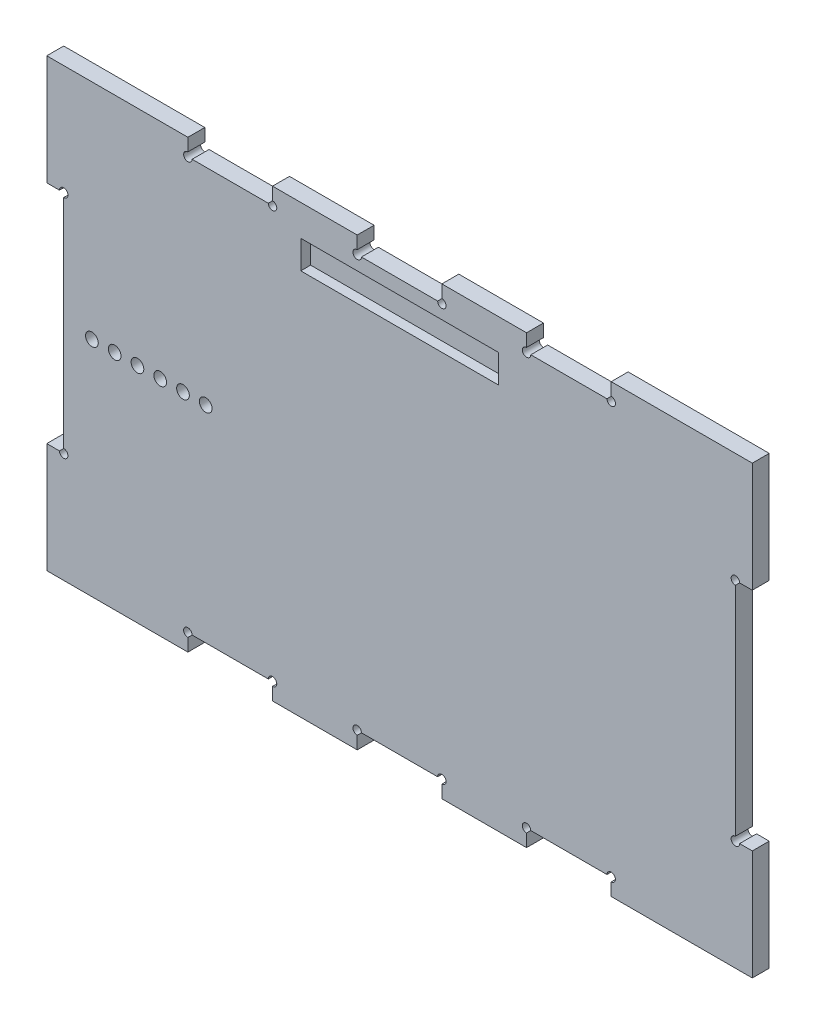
ISO-10303-21;
HEADER;
FILE_DESCRIPTION(('STEP AP214'),'2;1');
FILE_NAME('part.step','',(''),(''),'','','');
FILE_SCHEMA(('AUTOMOTIVE_DESIGN { 1 0 10303 214 1 1 1 1 }'));
ENDSEC;
DATA;
#1=APPLICATION_CONTEXT('core data for automotive mechanical design processes');
#2=APPLICATION_PROTOCOL_DEFINITION('international standard','automotive_design',2000,#1);
#3=PRODUCT_CONTEXT('',#1,'mechanical');
#4=PRODUCT('Part','Part','',(#3));
#5=PRODUCT_RELATED_PRODUCT_CATEGORY('part','',(#4));
#6=PRODUCT_DEFINITION_FORMATION('','',#4);
#7=PRODUCT_DEFINITION_CONTEXT('part definition',#1,'design');
#8=PRODUCT_DEFINITION('design','',#6,#7);
#9=PRODUCT_DEFINITION_SHAPE('','',#8);
#10=(LENGTH_UNIT() NAMED_UNIT(*) SI_UNIT(.MILLI.,.METRE.));
#11=(NAMED_UNIT(*) PLANE_ANGLE_UNIT() SI_UNIT($,.RADIAN.));
#12=(NAMED_UNIT(*) SI_UNIT($,.STERADIAN.) SOLID_ANGLE_UNIT());
#13=UNCERTAINTY_MEASURE_WITH_UNIT(LENGTH_MEASURE(1.E-05),#10,'distance_accuracy_value','');
#14=(GEOMETRIC_REPRESENTATION_CONTEXT(3) GLOBAL_UNCERTAINTY_ASSIGNED_CONTEXT((#13)) GLOBAL_UNIT_ASSIGNED_CONTEXT((#10,
#11,#12)) REPRESENTATION_CONTEXT('',''));
#15=CARTESIAN_POINT('',(0.,0.,0.));
#16=DIRECTION('',(0.,0.,1.));
#17=DIRECTION('',(1.,0.,0.));
#18=AXIS2_PLACEMENT_3D('',#15,#16,#17);
#19=CARTESIAN_POINT('',(-97.7519233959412,36.2844490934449,6.));
#20=DIRECTION('',(1.,0.,0.));
#21=DIRECTION('',(0.,0.,-1.));
#22=AXIS2_PLACEMENT_3D('',#19,#20,#21);
#23=PLANE('',#22);
#24=DIRECTION('',(0.,-1.,0.));
#25=VECTOR('',#24,1.);
#26=CARTESIAN_POINT('',(-97.7519233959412,36.2844490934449,0.));
#27=LINE('',#26,#25);
#28=CARTESIAN_POINT('',(-97.7519233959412,39.,0.));
#29=VERTEX_POINT('',#28);
#30=CARTESIAN_POINT('',(-97.7519233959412,0.,0.));
#31=VERTEX_POINT('',#30);
#32=EDGE_CURVE('E569',#29,#31,#27,.T.);
#33=ORIENTED_EDGE('',*,*,#32,.T.);
#34=DIRECTION('',(0.,0.,-1.));
#35=VECTOR('',#34,1.);
#36=CARTESIAN_POINT('',(-97.7519233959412,0.,6.));
#37=LINE('',#36,#35);
#38=CARTESIAN_POINT('',(-97.7519233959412,0.,6.));
#39=VERTEX_POINT('',#38);
#40=EDGE_CURVE('E787',#39,#31,#37,.T.);
#41=ORIENTED_EDGE('',*,*,#40,.F.);
#42=DIRECTION('',(0.,-1.,0.));
#43=VECTOR('',#42,1.);
#44=CARTESIAN_POINT('',(-97.7519233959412,39.,6.));
#45=LINE('',#44,#43);
#46=CARTESIAN_POINT('',(-97.7519233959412,39.,6.));
#47=VERTEX_POINT('',#46);
#48=EDGE_CURVE('E570',#47,#39,#45,.T.);
#49=ORIENTED_EDGE('',*,*,#48,.F.);
#50=DIRECTION('',(0.,0.,-1.));
#51=VECTOR('',#50,1.);
#52=CARTESIAN_POINT('',(-97.7519233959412,39.,6.));
#53=LINE('',#52,#51);
#54=EDGE_CURVE('E651',#47,#29,#53,.T.);
#55=ORIENTED_EDGE('',*,*,#54,.T.);
#56=EDGE_LOOP('',(#33,#41,#49,#55));
#57=FACE_BOUND('',#56,.T.);
#58=ADVANCED_FACE('F30',(#57),#23,.F.);
#59=CARTESIAN_POINT('',(-97.7519233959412,0.,6.));
#60=DIRECTION('',(0.,1.,0.));
#61=DIRECTION('',(0.,0.,1.));
#62=AXIS2_PLACEMENT_3D('',#59,#60,#61);
#63=PLANE('',#62);
#64=DIRECTION('',(1.,0.,0.));
#65=VECTOR('',#64,1.);
#66=CARTESIAN_POINT('',(-97.7519233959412,0.,0.));
#67=LINE('',#66,#65);
#68=CARTESIAN_POINT('',(-93.2519233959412,0.,0.));
#69=VERTEX_POINT('',#68);
#70=EDGE_CURVE('E653',#31,#69,#67,.T.);
#71=ORIENTED_EDGE('',*,*,#70,.T.);
#72=DIRECTION('',(0.,0.,1.));
#73=VECTOR('',#72,1.);
#74=CARTESIAN_POINT('',(-93.2519233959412,0.,0.));
#75=LINE('',#74,#73);
#76=CARTESIAN_POINT('',(-93.2519233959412,0.,6.));
#77=VERTEX_POINT('',#76);
#78=EDGE_CURVE('E52',#69,#77,#75,.T.);
#79=ORIENTED_EDGE('',*,*,#78,.T.);
#80=DIRECTION('',(1.,0.,0.));
#81=VECTOR('',#80,1.);
#82=CARTESIAN_POINT('',(-97.7519233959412,0.,6.));
#83=LINE('',#82,#81);
#84=EDGE_CURVE('E572',#39,#77,#83,.T.);
#85=ORIENTED_EDGE('',*,*,#84,.F.);
#86=ORIENTED_EDGE('',*,*,#40,.T.);
#87=EDGE_LOOP('',(#71,#79,#85,#86));
#88=FACE_BOUND('',#87,.T.);
#89=ADVANCED_FACE('F846',(#88),#63,.F.);
#90=CARTESIAN_POINT('',(-91.7519233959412,0.,6.));
#91=DIRECTION('',(1.,0.,0.));
#92=DIRECTION('',(0.,1.,0.));
#93=AXIS2_PLACEMENT_3D('',#90,#91,#92);
#94=PLANE('',#93);
#95=DIRECTION('',(0.,-1.,0.));
#96=VECTOR('',#95,1.);
#97=CARTESIAN_POINT('',(-91.7519233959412,0.,6.));
#98=LINE('',#97,#96);
#99=CARTESIAN_POINT('',(-91.7519233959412,-1.5,6.));
#100=VERTEX_POINT('',#99);
#101=CARTESIAN_POINT('',(-91.7519233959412,-78.5,6.));
#102=VERTEX_POINT('',#101);
#103=EDGE_CURVE('E576',#100,#102,#98,.T.);
#104=ORIENTED_EDGE('',*,*,#103,.F.);
#105=DIRECTION('',(0.,0.,1.));
#106=VECTOR('',#105,1.);
#107=CARTESIAN_POINT('',(-91.7519233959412,-1.5,0.));
#108=LINE('',#107,#106);
#109=CARTESIAN_POINT('',(-91.7519233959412,-1.5,0.));
#110=VERTEX_POINT('',#109);
#111=EDGE_CURVE('E425',#100,#110,#108,.F.);
#112=ORIENTED_EDGE('',*,*,#111,.T.);
#113=DIRECTION('',(0.,-1.,0.));
#114=VECTOR('',#113,1.);
#115=CARTESIAN_POINT('',(-91.7519233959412,0.,0.));
#116=LINE('',#115,#114);
#117=CARTESIAN_POINT('',(-91.7519233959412,-78.5,0.));
#118=VERTEX_POINT('',#117);
#119=EDGE_CURVE('E656',#110,#118,#116,.T.);
#120=ORIENTED_EDGE('',*,*,#119,.T.);
#121=DIRECTION('',(0.,0.,1.));
#122=VECTOR('',#121,1.);
#123=CARTESIAN_POINT('',(-91.7519233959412,-78.5,0.));
#124=LINE('',#123,#122);
#125=EDGE_CURVE('E435',#118,#102,#124,.T.);
#126=ORIENTED_EDGE('',*,*,#125,.T.);
#127=EDGE_LOOP('',(#104,#112,#120,#126));
#128=FACE_BOUND('',#127,.T.);
#129=ADVANCED_FACE('F840',(#128),#94,.F.);
#130=CARTESIAN_POINT('',(-91.7519233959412,-80.,6.));
#131=DIRECTION('',(0.,-1.,0.));
#132=DIRECTION('',(0.,0.,-1.));
#133=AXIS2_PLACEMENT_3D('',#130,#131,#132);
#134=PLANE('',#133);
#135=DIRECTION('',(-1.,0.,0.));
#136=VECTOR('',#135,1.);
#137=CARTESIAN_POINT('',(-91.7519233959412,-80.,6.));
#138=LINE('',#137,#136);
#139=CARTESIAN_POINT('',(-93.2519233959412,-80.,6.));
#140=VERTEX_POINT('',#139);
#141=CARTESIAN_POINT('',(-97.7519233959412,-80.,6.));
#142=VERTEX_POINT('',#141);
#143=EDGE_CURVE('E578',#140,#142,#138,.T.);
#144=ORIENTED_EDGE('',*,*,#143,.F.);
#145=DIRECTION('',(0.,0.,1.));
#146=VECTOR('',#145,1.);
#147=CARTESIAN_POINT('',(-93.2519233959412,-80.,0.));
#148=LINE('',#147,#146);
#149=CARTESIAN_POINT('',(-93.2519233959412,-80.,0.));
#150=VERTEX_POINT('',#149);
#151=EDGE_CURVE('E432',#140,#150,#148,.F.);
#152=ORIENTED_EDGE('',*,*,#151,.T.);
#153=DIRECTION('',(-1.,0.,0.));
#154=VECTOR('',#153,1.);
#155=CARTESIAN_POINT('',(-91.7519233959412,-80.,0.));
#156=LINE('',#155,#154);
#157=CARTESIAN_POINT('',(-97.7519233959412,-80.,0.));
#158=VERTEX_POINT('',#157);
#159=EDGE_CURVE('E658',#150,#158,#156,.T.);
#160=ORIENTED_EDGE('',*,*,#159,.T.);
#161=DIRECTION('',(0.,0.,-1.));
#162=VECTOR('',#161,1.);
#163=CARTESIAN_POINT('',(-97.7519233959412,-80.,6.));
#164=LINE('',#163,#162);
#165=EDGE_CURVE('E784',#142,#158,#164,.T.);
#166=ORIENTED_EDGE('',*,*,#165,.F.);
#167=EDGE_LOOP('',(#144,#152,#160,#166));
#168=FACE_BOUND('',#167,.T.);
#169=ADVANCED_FACE('F831',(#168),#134,.F.);
#170=CARTESIAN_POINT('',(-97.7519233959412,-80.,6.));
#171=DIRECTION('',(1.,0.,0.));
#172=DIRECTION('',(0.,1.,0.));
#173=AXIS2_PLACEMENT_3D('',#170,#171,#172);
#174=PLANE('',#173);
#175=DIRECTION('',(0.,-1.,0.));
#176=VECTOR('',#175,1.);
#177=CARTESIAN_POINT('',(-97.7519233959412,-80.,0.));
#178=LINE('',#177,#176);
#179=CARTESIAN_POINT('',(-97.7519233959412,-119.,0.));
#180=VERTEX_POINT('',#179);
#181=EDGE_CURVE('E660',#158,#180,#178,.T.);
#182=ORIENTED_EDGE('',*,*,#181,.T.);
#183=DIRECTION('',(0.,0.,-1.));
#184=VECTOR('',#183,1.);
#185=CARTESIAN_POINT('',(-97.7519233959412,-119.,6.));
#186=LINE('',#185,#184);
#187=CARTESIAN_POINT('',(-97.7519233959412,-119.,6.));
#188=VERTEX_POINT('',#187);
#189=EDGE_CURVE('E781',#188,#180,#186,.T.);
#190=ORIENTED_EDGE('',*,*,#189,.F.);
#191=DIRECTION('',(0.,-1.,0.));
#192=VECTOR('',#191,1.);
#193=CARTESIAN_POINT('',(-97.7519233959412,-80.,6.));
#194=LINE('',#193,#192);
#195=EDGE_CURVE('E580',#142,#188,#194,.T.);
#196=ORIENTED_EDGE('',*,*,#195,.F.);
#197=ORIENTED_EDGE('',*,*,#165,.T.);
#198=EDGE_LOOP('',(#182,#190,#196,#197));
#199=FACE_BOUND('',#198,.T.);
#200=ADVANCED_FACE('F867',(#199),#174,.F.);
#201=CARTESIAN_POINT('',(-97.7519233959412,-119.,6.));
#202=DIRECTION('',(0.,1.,0.));
#203=DIRECTION('',(0.,0.,1.));
#204=AXIS2_PLACEMENT_3D('',#201,#202,#203);
#205=PLANE('',#204);
#206=DIRECTION('',(1.,0.,0.));
#207=VECTOR('',#206,1.);
#208=CARTESIAN_POINT('',(-97.7519233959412,-119.,0.));
#209=LINE('',#208,#207);
#210=CARTESIAN_POINT('',(-47.7519233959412,-119.,0.));
#211=VERTEX_POINT('',#210);
#212=EDGE_CURVE('E662',#180,#211,#209,.T.);
#213=ORIENTED_EDGE('',*,*,#212,.T.);
#214=DIRECTION('',(0.,0.,-1.));
#215=VECTOR('',#214,1.);
#216=CARTESIAN_POINT('',(-47.7519233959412,-119.,6.));
#217=LINE('',#216,#215);
#218=CARTESIAN_POINT('',(-47.7519233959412,-119.,6.));
#219=VERTEX_POINT('',#218);
#220=EDGE_CURVE('E778',#219,#211,#217,.T.);
#221=ORIENTED_EDGE('',*,*,#220,.F.);
#222=DIRECTION('',(1.,0.,0.));
#223=VECTOR('',#222,1.);
#224=CARTESIAN_POINT('',(-97.7519233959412,-119.,6.));
#225=LINE('',#224,#223);
#226=EDGE_CURVE('E582',#188,#219,#225,.T.);
#227=ORIENTED_EDGE('',*,*,#226,.F.);
#228=ORIENTED_EDGE('',*,*,#189,.T.);
#229=EDGE_LOOP('',(#213,#221,#227,#228));
#230=FACE_BOUND('',#229,.T.);
#231=ADVANCED_FACE('F870',(#230),#205,.F.);
#232=CARTESIAN_POINT('',(-47.7519233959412,-119.,6.));
#233=DIRECTION('',(-1.,0.,0.));
#234=DIRECTION('',(0.,0.,1.));
#235=AXIS2_PLACEMENT_3D('',#232,#233,#234);
#236=PLANE('',#235);
#237=DIRECTION('',(0.,1.,0.));
#238=VECTOR('',#237,1.);
#239=CARTESIAN_POINT('',(-47.7519233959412,-119.,0.));
#240=LINE('',#239,#238);
#241=CARTESIAN_POINT('',(-47.7519233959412,-114.5,0.));
#242=VERTEX_POINT('',#241);
#243=EDGE_CURVE('E664',#211,#242,#240,.T.);
#244=ORIENTED_EDGE('',*,*,#243,.T.);
#245=DIRECTION('',(0.,0.,1.));
#246=VECTOR('',#245,1.);
#247=CARTESIAN_POINT('',(-47.7519233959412,-114.5,0.));
#248=LINE('',#247,#246);
#249=CARTESIAN_POINT('',(-47.7519233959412,-114.5,6.));
#250=VERTEX_POINT('',#249);
#251=EDGE_CURVE('E446',#242,#250,#248,.T.);
#252=ORIENTED_EDGE('',*,*,#251,.T.);
#253=DIRECTION('',(0.,1.,0.));
#254=VECTOR('',#253,1.);
#255=CARTESIAN_POINT('',(-47.7519233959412,-119.,6.));
#256=LINE('',#255,#254);
#257=EDGE_CURVE('E584',#219,#250,#256,.T.);
#258=ORIENTED_EDGE('',*,*,#257,.F.);
#259=ORIENTED_EDGE('',*,*,#220,.T.);
#260=EDGE_LOOP('',(#244,#252,#258,#259));
#261=FACE_BOUND('',#260,.T.);
#262=ADVANCED_FACE('F874',(#261),#236,.F.);
#263=CARTESIAN_POINT('',(-47.7519233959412,-113.,6.));
#264=DIRECTION('',(0.,1.,0.));
#265=DIRECTION('',(0.,0.,1.));
#266=AXIS2_PLACEMENT_3D('',#263,#264,#265);
#267=PLANE('',#266);
#268=DIRECTION('',(1.,0.,0.));
#269=VECTOR('',#268,1.);
#270=CARTESIAN_POINT('',(-47.7519233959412,-113.,6.));
#271=LINE('',#270,#269);
#272=CARTESIAN_POINT('',(-46.2519233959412,-113.,6.));
#273=VERTEX_POINT('',#272);
#274=CARTESIAN_POINT('',(-19.2519233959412,-113.,6.));
#275=VERTEX_POINT('',#274);
#276=EDGE_CURVE('E587',#273,#275,#271,.T.);
#277=ORIENTED_EDGE('',*,*,#276,.F.);
#278=DIRECTION('',(0.,0.,1.));
#279=VECTOR('',#278,1.);
#280=CARTESIAN_POINT('',(-46.2519233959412,-113.,0.));
#281=LINE('',#280,#279);
#282=CARTESIAN_POINT('',(-46.2519233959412,-113.,0.));
#283=VERTEX_POINT('',#282);
#284=EDGE_CURVE('E442',#273,#283,#281,.F.);
#285=ORIENTED_EDGE('',*,*,#284,.T.);
#286=DIRECTION('',(1.,0.,0.));
#287=VECTOR('',#286,1.);
#288=CARTESIAN_POINT('',(-47.7519233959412,-113.,0.));
#289=LINE('',#288,#287);
#290=CARTESIAN_POINT('',(-19.2519233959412,-113.,0.));
#291=VERTEX_POINT('',#290);
#292=EDGE_CURVE('E667',#283,#291,#289,.T.);
#293=ORIENTED_EDGE('',*,*,#292,.T.);
#294=DIRECTION('',(0.,0.,1.));
#295=VECTOR('',#294,1.);
#296=CARTESIAN_POINT('',(-19.2519233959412,-113.,0.));
#297=LINE('',#296,#295);
#298=EDGE_CURVE('E455',#291,#275,#297,.T.);
#299=ORIENTED_EDGE('',*,*,#298,.T.);
#300=EDGE_LOOP('',(#277,#285,#293,#299));
#301=FACE_BOUND('',#300,.T.);
#302=ADVANCED_FACE('F878',(#301),#267,.F.);
#303=CARTESIAN_POINT('',(-17.7519233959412,-113.,6.));
#304=DIRECTION('',(1.,0.,0.));
#305=DIRECTION('',(0.,1.,0.));
#306=AXIS2_PLACEMENT_3D('',#303,#304,#305);
#307=PLANE('',#306);
#308=DIRECTION('',(0.,-1.,0.));
#309=VECTOR('',#308,1.);
#310=CARTESIAN_POINT('',(-17.7519233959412,-113.,6.));
#311=LINE('',#310,#309);
#312=CARTESIAN_POINT('',(-17.7519233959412,-114.5,6.));
#313=VERTEX_POINT('',#312);
#314=CARTESIAN_POINT('',(-17.7519233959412,-119.,6.));
#315=VERTEX_POINT('',#314);
#316=EDGE_CURVE('E589',#313,#315,#311,.T.);
#317=ORIENTED_EDGE('',*,*,#316,.F.);
#318=DIRECTION('',(0.,0.,1.));
#319=VECTOR('',#318,1.);
#320=CARTESIAN_POINT('',(-17.7519233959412,-114.5,0.));
#321=LINE('',#320,#319);
#322=CARTESIAN_POINT('',(-17.7519233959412,-114.5,0.));
#323=VERTEX_POINT('',#322);
#324=EDGE_CURVE('E452',#313,#323,#321,.F.);
#325=ORIENTED_EDGE('',*,*,#324,.T.);
#326=DIRECTION('',(0.,-1.,0.));
#327=VECTOR('',#326,1.);
#328=CARTESIAN_POINT('',(-17.7519233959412,-113.,0.));
#329=LINE('',#328,#327);
#330=CARTESIAN_POINT('',(-17.7519233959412,-119.,0.));
#331=VERTEX_POINT('',#330);
#332=EDGE_CURVE('E669',#323,#331,#329,.T.);
#333=ORIENTED_EDGE('',*,*,#332,.T.);
#334=DIRECTION('',(0.,0.,-1.));
#335=VECTOR('',#334,1.);
#336=CARTESIAN_POINT('',(-17.7519233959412,-119.,6.));
#337=LINE('',#336,#335);
#338=EDGE_CURVE('E775',#315,#331,#337,.T.);
#339=ORIENTED_EDGE('',*,*,#338,.F.);
#340=EDGE_LOOP('',(#317,#325,#333,#339));
#341=FACE_BOUND('',#340,.T.);
#342=ADVANCED_FACE('F882',(#341),#307,.F.);
#343=CARTESIAN_POINT('',(-17.7519233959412,-119.,6.));
#344=DIRECTION('',(0.,1.,0.));
#345=DIRECTION('',(0.,0.,1.));
#346=AXIS2_PLACEMENT_3D('',#343,#344,#345);
#347=PLANE('',#346);
#348=DIRECTION('',(1.,0.,0.));
#349=VECTOR('',#348,1.);
#350=CARTESIAN_POINT('',(-17.7519233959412,-119.,0.));
#351=LINE('',#350,#349);
#352=CARTESIAN_POINT('',(12.2480766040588,-119.,0.));
#353=VERTEX_POINT('',#352);
#354=EDGE_CURVE('E671',#331,#353,#351,.T.);
#355=ORIENTED_EDGE('',*,*,#354,.T.);
#356=DIRECTION('',(0.,0.,-1.));
#357=VECTOR('',#356,1.);
#358=CARTESIAN_POINT('',(12.2480766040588,-119.,6.));
#359=LINE('',#358,#357);
#360=CARTESIAN_POINT('',(12.2480766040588,-119.,6.));
#361=VERTEX_POINT('',#360);
#362=EDGE_CURVE('E772',#361,#353,#359,.T.);
#363=ORIENTED_EDGE('',*,*,#362,.F.);
#364=DIRECTION('',(1.,0.,0.));
#365=VECTOR('',#364,1.);
#366=CARTESIAN_POINT('',(-17.7519233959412,-119.,6.));
#367=LINE('',#366,#365);
#368=EDGE_CURVE('E591',#315,#361,#367,.T.);
#369=ORIENTED_EDGE('',*,*,#368,.F.);
#370=ORIENTED_EDGE('',*,*,#338,.T.);
#371=EDGE_LOOP('',(#355,#363,#369,#370));
#372=FACE_BOUND('',#371,.T.);
#373=ADVANCED_FACE('F886',(#372),#347,.F.);
#374=CARTESIAN_POINT('',(12.2480766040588,-119.,6.));
#375=DIRECTION('',(-1.,0.,0.));
#376=DIRECTION('',(0.,-1.,0.));
#377=AXIS2_PLACEMENT_3D('',#374,#375,#376);
#378=PLANE('',#377);
#379=DIRECTION('',(0.,1.,0.));
#380=VECTOR('',#379,1.);
#381=CARTESIAN_POINT('',(12.2480766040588,-119.,0.));
#382=LINE('',#381,#380);
#383=CARTESIAN_POINT('',(12.2480766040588,-114.5,0.));
#384=VERTEX_POINT('',#383);
#385=EDGE_CURVE('E673',#353,#384,#382,.T.);
#386=ORIENTED_EDGE('',*,*,#385,.T.);
#387=DIRECTION('',(0.,0.,1.));
#388=VECTOR('',#387,1.);
#389=CARTESIAN_POINT('',(12.2480766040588,-114.5,0.));
#390=LINE('',#389,#388);
#391=CARTESIAN_POINT('',(12.2480766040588,-114.5,6.));
#392=VERTEX_POINT('',#391);
#393=EDGE_CURVE('E466',#384,#392,#390,.T.);
#394=ORIENTED_EDGE('',*,*,#393,.T.);
#395=DIRECTION('',(0.,1.,0.));
#396=VECTOR('',#395,1.);
#397=CARTESIAN_POINT('',(12.2480766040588,-119.,6.));
#398=LINE('',#397,#396);
#399=EDGE_CURVE('E593',#361,#392,#398,.T.);
#400=ORIENTED_EDGE('',*,*,#399,.F.);
#401=ORIENTED_EDGE('',*,*,#362,.T.);
#402=EDGE_LOOP('',(#386,#394,#400,#401));
#403=FACE_BOUND('',#402,.T.);
#404=ADVANCED_FACE('F890',(#403),#378,.F.);
#405=CARTESIAN_POINT('',(12.2480766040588,-113.,6.));
#406=DIRECTION('',(0.,1.,0.));
#407=DIRECTION('',(0.,0.,1.));
#408=AXIS2_PLACEMENT_3D('',#405,#406,#407);
#409=PLANE('',#408);
#410=DIRECTION('',(1.,0.,0.));
#411=VECTOR('',#410,1.);
#412=CARTESIAN_POINT('',(12.2480766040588,-113.,6.));
#413=LINE('',#412,#411);
#414=CARTESIAN_POINT('',(13.7480766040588,-113.,6.));
#415=VERTEX_POINT('',#414);
#416=CARTESIAN_POINT('',(40.7480766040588,-113.,6.));
#417=VERTEX_POINT('',#416);
#418=EDGE_CURVE('E596',#415,#417,#413,.T.);
#419=ORIENTED_EDGE('',*,*,#418,.F.);
#420=DIRECTION('',(0.,0.,1.));
#421=VECTOR('',#420,1.);
#422=CARTESIAN_POINT('',(13.7480766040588,-113.,0.));
#423=LINE('',#422,#421);
#424=CARTESIAN_POINT('',(13.7480766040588,-113.,0.));
#425=VERTEX_POINT('',#424);
#426=EDGE_CURVE('E462',#415,#425,#423,.F.);
#427=ORIENTED_EDGE('',*,*,#426,.T.);
#428=DIRECTION('',(1.,0.,0.));
#429=VECTOR('',#428,1.);
#430=CARTESIAN_POINT('',(12.2480766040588,-113.,0.));
#431=LINE('',#430,#429);
#432=CARTESIAN_POINT('',(40.7480766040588,-113.,0.));
#433=VERTEX_POINT('',#432);
#434=EDGE_CURVE('E676',#425,#433,#431,.T.);
#435=ORIENTED_EDGE('',*,*,#434,.T.);
#436=DIRECTION('',(0.,0.,1.));
#437=VECTOR('',#436,1.);
#438=CARTESIAN_POINT('',(40.7480766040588,-113.,0.));
#439=LINE('',#438,#437);
#440=EDGE_CURVE('E475',#433,#417,#439,.T.);
#441=ORIENTED_EDGE('',*,*,#440,.T.);
#442=EDGE_LOOP('',(#419,#427,#435,#441));
#443=FACE_BOUND('',#442,.T.);
#444=ADVANCED_FACE('F894',(#443),#409,.F.);
#445=CARTESIAN_POINT('',(42.2480766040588,-113.,6.));
#446=DIRECTION('',(1.,0.,0.));
#447=DIRECTION('',(0.,0.,-1.));
#448=AXIS2_PLACEMENT_3D('',#445,#446,#447);
#449=PLANE('',#448);
#450=DIRECTION('',(0.,-1.,0.));
#451=VECTOR('',#450,1.);
#452=CARTESIAN_POINT('',(42.2480766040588,-113.,6.));
#453=LINE('',#452,#451);
#454=CARTESIAN_POINT('',(42.2480766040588,-114.5,6.));
#455=VERTEX_POINT('',#454);
#456=CARTESIAN_POINT('',(42.2480766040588,-119.,6.));
#457=VERTEX_POINT('',#456);
#458=EDGE_CURVE('E598',#455,#457,#453,.T.);
#459=ORIENTED_EDGE('',*,*,#458,.F.);
#460=DIRECTION('',(0.,0.,1.));
#461=VECTOR('',#460,1.);
#462=CARTESIAN_POINT('',(42.2480766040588,-114.5,0.));
#463=LINE('',#462,#461);
#464=CARTESIAN_POINT('',(42.2480766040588,-114.5,0.));
#465=VERTEX_POINT('',#464);
#466=EDGE_CURVE('E472',#455,#465,#463,.F.);
#467=ORIENTED_EDGE('',*,*,#466,.T.);
#468=DIRECTION('',(0.,-1.,0.));
#469=VECTOR('',#468,1.);
#470=CARTESIAN_POINT('',(42.2480766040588,-113.,0.));
#471=LINE('',#470,#469);
#472=CARTESIAN_POINT('',(42.2480766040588,-119.,0.));
#473=VERTEX_POINT('',#472);
#474=EDGE_CURVE('E678',#465,#473,#471,.T.);
#475=ORIENTED_EDGE('',*,*,#474,.T.);
#476=DIRECTION('',(0.,0.,-1.));
#477=VECTOR('',#476,1.);
#478=CARTESIAN_POINT('',(42.2480766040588,-119.,6.));
#479=LINE('',#478,#477);
#480=EDGE_CURVE('E769',#457,#473,#479,.T.);
#481=ORIENTED_EDGE('',*,*,#480,.F.);
#482=EDGE_LOOP('',(#459,#467,#475,#481));
#483=FACE_BOUND('',#482,.T.);
#484=ADVANCED_FACE('F898',(#483),#449,.F.);
#485=CARTESIAN_POINT('',(42.2480766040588,-119.,6.));
#486=DIRECTION('',(0.,1.,0.));
#487=DIRECTION('',(0.,0.,1.));
#488=AXIS2_PLACEMENT_3D('',#485,#486,#487);
#489=PLANE('',#488);
#490=DIRECTION('',(1.,0.,0.));
#491=VECTOR('',#490,1.);
#492=CARTESIAN_POINT('',(42.2480766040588,-119.,0.));
#493=LINE('',#492,#491);
#494=CARTESIAN_POINT('',(72.2480766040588,-119.,0.));
#495=VERTEX_POINT('',#494);
#496=EDGE_CURVE('E680',#473,#495,#493,.T.);
#497=ORIENTED_EDGE('',*,*,#496,.T.);
#498=DIRECTION('',(0.,0.,-1.));
#499=VECTOR('',#498,1.);
#500=CARTESIAN_POINT('',(72.2480766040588,-119.,6.));
#501=LINE('',#500,#499);
#502=CARTESIAN_POINT('',(72.2480766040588,-119.,6.));
#503=VERTEX_POINT('',#502);
#504=EDGE_CURVE('E766',#503,#495,#501,.T.);
#505=ORIENTED_EDGE('',*,*,#504,.F.);
#506=DIRECTION('',(1.,0.,0.));
#507=VECTOR('',#506,1.);
#508=CARTESIAN_POINT('',(42.2480766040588,-119.,6.));
#509=LINE('',#508,#507);
#510=EDGE_CURVE('E600',#457,#503,#509,.T.);
#511=ORIENTED_EDGE('',*,*,#510,.F.);
#512=ORIENTED_EDGE('',*,*,#480,.T.);
#513=EDGE_LOOP('',(#497,#505,#511,#512));
#514=FACE_BOUND('',#513,.T.);
#515=ADVANCED_FACE('F902',(#514),#489,.F.);
#516=CARTESIAN_POINT('',(72.2480766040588,-119.,6.));
#517=DIRECTION('',(-1.,0.,0.));
#518=DIRECTION('',(0.,0.,1.));
#519=AXIS2_PLACEMENT_3D('',#516,#517,#518);
#520=PLANE('',#519);
#521=DIRECTION('',(0.,1.,0.));
#522=VECTOR('',#521,1.);
#523=CARTESIAN_POINT('',(72.2480766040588,-119.,0.));
#524=LINE('',#523,#522);
#525=CARTESIAN_POINT('',(72.2480766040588,-114.5,0.));
#526=VERTEX_POINT('',#525);
#527=EDGE_CURVE('E682',#495,#526,#524,.T.);
#528=ORIENTED_EDGE('',*,*,#527,.T.);
#529=DIRECTION('',(0.,0.,1.));
#530=VECTOR('',#529,1.);
#531=CARTESIAN_POINT('',(72.2480766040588,-114.5,0.));
#532=LINE('',#531,#530);
#533=CARTESIAN_POINT('',(72.2480766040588,-114.5,6.));
#534=VERTEX_POINT('',#533);
#535=EDGE_CURVE('E486',#526,#534,#532,.T.);
#536=ORIENTED_EDGE('',*,*,#535,.T.);
#537=DIRECTION('',(0.,1.,0.));
#538=VECTOR('',#537,1.);
#539=CARTESIAN_POINT('',(72.2480766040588,-119.,6.));
#540=LINE('',#539,#538);
#541=EDGE_CURVE('E602',#503,#534,#540,.T.);
#542=ORIENTED_EDGE('',*,*,#541,.F.);
#543=ORIENTED_EDGE('',*,*,#504,.T.);
#544=EDGE_LOOP('',(#528,#536,#542,#543));
#545=FACE_BOUND('',#544,.T.);
#546=ADVANCED_FACE('F906',(#545),#520,.F.);
#547=CARTESIAN_POINT('',(72.2480766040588,-113.,6.));
#548=DIRECTION('',(0.,1.,0.));
#549=DIRECTION('',(0.,0.,1.));
#550=AXIS2_PLACEMENT_3D('',#547,#548,#549);
#551=PLANE('',#550);
#552=DIRECTION('',(1.,0.,0.));
#553=VECTOR('',#552,1.);
#554=CARTESIAN_POINT('',(72.2480766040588,-113.,6.));
#555=LINE('',#554,#553);
#556=CARTESIAN_POINT('',(73.7480766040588,-113.,6.));
#557=VERTEX_POINT('',#556);
#558=CARTESIAN_POINT('',(100.748076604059,-113.,6.));
#559=VERTEX_POINT('',#558);
#560=EDGE_CURVE('E605',#557,#559,#555,.T.);
#561=ORIENTED_EDGE('',*,*,#560,.F.);
#562=DIRECTION('',(0.,0.,1.));
#563=VECTOR('',#562,1.);
#564=CARTESIAN_POINT('',(73.7480766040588,-113.,0.));
#565=LINE('',#564,#563);
#566=CARTESIAN_POINT('',(73.7480766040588,-113.,0.));
#567=VERTEX_POINT('',#566);
#568=EDGE_CURVE('E482',#557,#567,#565,.F.);
#569=ORIENTED_EDGE('',*,*,#568,.T.);
#570=DIRECTION('',(1.,0.,0.));
#571=VECTOR('',#570,1.);
#572=CARTESIAN_POINT('',(72.2480766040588,-113.,0.));
#573=LINE('',#572,#571);
#574=CARTESIAN_POINT('',(100.748076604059,-113.,0.));
#575=VERTEX_POINT('',#574);
#576=EDGE_CURVE('E685',#567,#575,#573,.T.);
#577=ORIENTED_EDGE('',*,*,#576,.T.);
#578=DIRECTION('',(0.,0.,1.));
#579=VECTOR('',#578,1.);
#580=CARTESIAN_POINT('',(100.748076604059,-113.,0.));
#581=LINE('',#580,#579);
#582=EDGE_CURVE('E495',#575,#559,#581,.T.);
#583=ORIENTED_EDGE('',*,*,#582,.T.);
#584=EDGE_LOOP('',(#561,#569,#577,#583));
#585=FACE_BOUND('',#584,.T.);
#586=ADVANCED_FACE('F910',(#585),#551,.F.);
#587=CARTESIAN_POINT('',(102.248076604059,-113.,6.));
#588=DIRECTION('',(1.,0.,0.));
#589=DIRECTION('',(0.,0.,-1.));
#590=AXIS2_PLACEMENT_3D('',#587,#588,#589);
#591=PLANE('',#590);
#592=DIRECTION('',(0.,-1.,0.));
#593=VECTOR('',#592,1.);
#594=CARTESIAN_POINT('',(102.248076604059,-113.,6.));
#595=LINE('',#594,#593);
#596=CARTESIAN_POINT('',(102.248076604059,-114.5,6.));
#597=VERTEX_POINT('',#596);
#598=CARTESIAN_POINT('',(102.248076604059,-119.,6.));
#599=VERTEX_POINT('',#598);
#600=EDGE_CURVE('E607',#597,#599,#595,.T.);
#601=ORIENTED_EDGE('',*,*,#600,.F.);
#602=DIRECTION('',(0.,0.,1.));
#603=VECTOR('',#602,1.);
#604=CARTESIAN_POINT('',(102.248076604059,-114.5,0.));
#605=LINE('',#604,#603);
#606=CARTESIAN_POINT('',(102.248076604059,-114.5,0.));
#607=VERTEX_POINT('',#606);
#608=EDGE_CURVE('E492',#597,#607,#605,.F.);
#609=ORIENTED_EDGE('',*,*,#608,.T.);
#610=DIRECTION('',(0.,-1.,0.));
#611=VECTOR('',#610,1.);
#612=CARTESIAN_POINT('',(102.248076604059,-113.,0.));
#613=LINE('',#612,#611);
#614=CARTESIAN_POINT('',(102.248076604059,-119.,0.));
#615=VERTEX_POINT('',#614);
#616=EDGE_CURVE('E687',#607,#615,#613,.T.);
#617=ORIENTED_EDGE('',*,*,#616,.T.);
#618=DIRECTION('',(0.,0.,-1.));
#619=VECTOR('',#618,1.);
#620=CARTESIAN_POINT('',(102.248076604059,-119.,6.));
#621=LINE('',#620,#619);
#622=EDGE_CURVE('E763',#599,#615,#621,.T.);
#623=ORIENTED_EDGE('',*,*,#622,.F.);
#624=EDGE_LOOP('',(#601,#609,#617,#623));
#625=FACE_BOUND('',#624,.T.);
#626=ADVANCED_FACE('F914',(#625),#591,.F.);
#627=CARTESIAN_POINT('',(102.248076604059,-119.,6.));
#628=DIRECTION('',(0.,1.,0.));
#629=DIRECTION('',(0.,0.,1.));
#630=AXIS2_PLACEMENT_3D('',#627,#628,#629);
#631=PLANE('',#630);
#632=DIRECTION('',(1.,0.,0.));
#633=VECTOR('',#632,1.);
#634=CARTESIAN_POINT('',(102.248076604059,-119.,0.));
#635=LINE('',#634,#633);
#636=CARTESIAN_POINT('',(152.248076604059,-119.,0.));
#637=VERTEX_POINT('',#636);
#638=EDGE_CURVE('E689',#615,#637,#635,.T.);
#639=ORIENTED_EDGE('',*,*,#638,.T.);
#640=DIRECTION('',(0.,0.,-1.));
#641=VECTOR('',#640,1.);
#642=CARTESIAN_POINT('',(152.248076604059,-119.,6.));
#643=LINE('',#642,#641);
#644=CARTESIAN_POINT('',(152.248076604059,-119.,6.));
#645=VERTEX_POINT('',#644);
#646=EDGE_CURVE('E760',#645,#637,#643,.T.);
#647=ORIENTED_EDGE('',*,*,#646,.F.);
#648=DIRECTION('',(1.,0.,0.));
#649=VECTOR('',#648,1.);
#650=CARTESIAN_POINT('',(102.248076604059,-119.,6.));
#651=LINE('',#650,#649);
#652=EDGE_CURVE('E609',#599,#645,#651,.T.);
#653=ORIENTED_EDGE('',*,*,#652,.F.);
#654=ORIENTED_EDGE('',*,*,#622,.T.);
#655=EDGE_LOOP('',(#639,#647,#653,#654));
#656=FACE_BOUND('',#655,.T.);
#657=ADVANCED_FACE('F918',(#656),#631,.F.);
#658=CARTESIAN_POINT('',(152.248076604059,-119.,6.));
#659=DIRECTION('',(-1.,0.,0.));
#660=DIRECTION('',(0.,0.,1.));
#661=AXIS2_PLACEMENT_3D('',#658,#659,#660);
#662=PLANE('',#661);
#663=DIRECTION('',(0.,1.,0.));
#664=VECTOR('',#663,1.);
#665=CARTESIAN_POINT('',(152.248076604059,-119.,0.));
#666=LINE('',#665,#664);
#667=CARTESIAN_POINT('',(152.248076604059,-80.,0.));
#668=VERTEX_POINT('',#667);
#669=EDGE_CURVE('E691',#637,#668,#666,.T.);
#670=ORIENTED_EDGE('',*,*,#669,.T.);
#671=DIRECTION('',(0.,0.,-1.));
#672=VECTOR('',#671,1.);
#673=CARTESIAN_POINT('',(152.248076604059,-80.,6.));
#674=LINE('',#673,#672);
#675=CARTESIAN_POINT('',(152.248076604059,-80.,6.));
#676=VERTEX_POINT('',#675);
#677=EDGE_CURVE('E757',#676,#668,#674,.T.);
#678=ORIENTED_EDGE('',*,*,#677,.F.);
#679=DIRECTION('',(0.,1.,0.));
#680=VECTOR('',#679,1.);
#681=CARTESIAN_POINT('',(152.248076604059,-119.,6.));
#682=LINE('',#681,#680);
#683=EDGE_CURVE('E611',#645,#676,#682,.T.);
#684=ORIENTED_EDGE('',*,*,#683,.F.);
#685=ORIENTED_EDGE('',*,*,#646,.T.);
#686=EDGE_LOOP('',(#670,#678,#684,#685));
#687=FACE_BOUND('',#686,.T.);
#688=ADVANCED_FACE('F922',(#687),#662,.F.);
#689=CARTESIAN_POINT('',(152.248076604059,-80.,6.));
#690=DIRECTION('',(0.,-1.,0.));
#691=DIRECTION('',(0.,0.,-1.));
#692=AXIS2_PLACEMENT_3D('',#689,#690,#691);
#693=PLANE('',#692);
#694=DIRECTION('',(-1.,0.,0.));
#695=VECTOR('',#694,1.);
#696=CARTESIAN_POINT('',(152.248076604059,-80.,0.));
#697=LINE('',#696,#695);
#698=CARTESIAN_POINT('',(147.748076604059,-80.,0.));
#699=VERTEX_POINT('',#698);
#700=EDGE_CURVE('E693',#668,#699,#697,.T.);
#701=ORIENTED_EDGE('',*,*,#700,.T.);
#702=DIRECTION('',(0.,0.,1.));
#703=VECTOR('',#702,1.);
#704=CARTESIAN_POINT('',(147.748076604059,-80.,0.));
#705=LINE('',#704,#703);
#706=CARTESIAN_POINT('',(147.748076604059,-80.,6.));
#707=VERTEX_POINT('',#706);
#708=EDGE_CURVE('E503',#699,#707,#705,.T.);
#709=ORIENTED_EDGE('',*,*,#708,.T.);
#710=DIRECTION('',(-1.,0.,0.));
#711=VECTOR('',#710,1.);
#712=CARTESIAN_POINT('',(152.248076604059,-80.,6.));
#713=LINE('',#712,#711);
#714=EDGE_CURVE('E613',#676,#707,#713,.T.);
#715=ORIENTED_EDGE('',*,*,#714,.F.);
#716=ORIENTED_EDGE('',*,*,#677,.T.);
#717=EDGE_LOOP('',(#701,#709,#715,#716));
#718=FACE_BOUND('',#717,.T.);
#719=ADVANCED_FACE('F926',(#718),#693,.F.);
#720=CARTESIAN_POINT('',(146.248076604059,-80.,6.));
#721=DIRECTION('',(-1.,0.,0.));
#722=DIRECTION('',(0.,0.,1.));
#723=AXIS2_PLACEMENT_3D('',#720,#721,#722);
#724=PLANE('',#723);
#725=DIRECTION('',(0.,1.,0.));
#726=VECTOR('',#725,1.);
#727=CARTESIAN_POINT('',(146.248076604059,-80.,6.));
#728=LINE('',#727,#726);
#729=CARTESIAN_POINT('',(146.248076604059,-78.5,6.));
#730=VERTEX_POINT('',#729);
#731=CARTESIAN_POINT('',(146.248076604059,-1.5,6.));
#732=VERTEX_POINT('',#731);
#733=EDGE_CURVE('E616',#730,#732,#728,.T.);
#734=ORIENTED_EDGE('',*,*,#733,.F.);
#735=DIRECTION('',(0.,0.,1.));
#736=VECTOR('',#735,1.);
#737=CARTESIAN_POINT('',(146.248076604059,-78.5,0.));
#738=LINE('',#737,#736);
#739=CARTESIAN_POINT('',(146.248076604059,-78.5,0.));
#740=VERTEX_POINT('',#739);
#741=EDGE_CURVE('E500',#730,#740,#738,.F.);
#742=ORIENTED_EDGE('',*,*,#741,.T.);
#743=DIRECTION('',(0.,1.,0.));
#744=VECTOR('',#743,1.);
#745=CARTESIAN_POINT('',(146.248076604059,-80.,0.));
#746=LINE('',#745,#744);
#747=CARTESIAN_POINT('',(146.248076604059,-1.5,0.));
#748=VERTEX_POINT('',#747);
#749=EDGE_CURVE('E696',#740,#748,#746,.T.);
#750=ORIENTED_EDGE('',*,*,#749,.T.);
#751=DIRECTION('',(0.,0.,1.));
#752=VECTOR('',#751,1.);
#753=CARTESIAN_POINT('',(146.248076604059,-1.5,0.));
#754=LINE('',#753,#752);
#755=EDGE_CURVE('E515',#748,#732,#754,.T.);
#756=ORIENTED_EDGE('',*,*,#755,.T.);
#757=EDGE_LOOP('',(#734,#742,#750,#756));
#758=FACE_BOUND('',#757,.T.);
#759=ADVANCED_FACE('F930',(#758),#724,.F.);
#760=CARTESIAN_POINT('',(146.248076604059,0.,6.));
#761=DIRECTION('',(0.,1.,0.));
#762=DIRECTION('',(0.,0.,1.));
#763=AXIS2_PLACEMENT_3D('',#760,#761,#762);
#764=PLANE('',#763);
#765=DIRECTION('',(1.,0.,0.));
#766=VECTOR('',#765,1.);
#767=CARTESIAN_POINT('',(146.248076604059,0.,6.));
#768=LINE('',#767,#766);
#769=CARTESIAN_POINT('',(147.748076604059,0.,6.));
#770=VERTEX_POINT('',#769);
#771=CARTESIAN_POINT('',(152.248076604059,0.,6.));
#772=VERTEX_POINT('',#771);
#773=EDGE_CURVE('E618',#770,#772,#768,.T.);
#774=ORIENTED_EDGE('',*,*,#773,.F.);
#775=DIRECTION('',(0.,0.,1.));
#776=VECTOR('',#775,1.);
#777=CARTESIAN_POINT('',(147.748076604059,0.,0.));
#778=LINE('',#777,#776);
#779=CARTESIAN_POINT('',(147.748076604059,0.,0.));
#780=VERTEX_POINT('',#779);
#781=EDGE_CURVE('E510',#770,#780,#778,.F.);
#782=ORIENTED_EDGE('',*,*,#781,.T.);
#783=DIRECTION('',(1.,0.,0.));
#784=VECTOR('',#783,1.);
#785=CARTESIAN_POINT('',(146.248076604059,0.,0.));
#786=LINE('',#785,#784);
#787=CARTESIAN_POINT('',(152.248076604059,0.,0.));
#788=VERTEX_POINT('',#787);
#789=EDGE_CURVE('E698',#780,#788,#786,.T.);
#790=ORIENTED_EDGE('',*,*,#789,.T.);
#791=DIRECTION('',(0.,0.,-1.));
#792=VECTOR('',#791,1.);
#793=CARTESIAN_POINT('',(152.248076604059,0.,6.));
#794=LINE('',#793,#792);
#795=EDGE_CURVE('E754',#772,#788,#794,.T.);
#796=ORIENTED_EDGE('',*,*,#795,.F.);
#797=EDGE_LOOP('',(#774,#782,#790,#796));
#798=FACE_BOUND('',#797,.T.);
#799=ADVANCED_FACE('F934',(#798),#764,.F.);
#800=CARTESIAN_POINT('',(152.248076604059,0.,6.));
#801=DIRECTION('',(-1.,0.,0.));
#802=DIRECTION('',(0.,0.,1.));
#803=AXIS2_PLACEMENT_3D('',#800,#801,#802);
#804=PLANE('',#803);
#805=DIRECTION('',(0.,1.,0.));
#806=VECTOR('',#805,1.);
#807=CARTESIAN_POINT('',(152.248076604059,0.,0.));
#808=LINE('',#807,#806);
#809=CARTESIAN_POINT('',(152.248076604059,39.,0.));
#810=VERTEX_POINT('',#809);
#811=EDGE_CURVE('E700',#788,#810,#808,.T.);
#812=ORIENTED_EDGE('',*,*,#811,.T.);
#813=DIRECTION('',(0.,0.,-1.));
#814=VECTOR('',#813,1.);
#815=CARTESIAN_POINT('',(152.248076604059,39.,6.));
#816=LINE('',#815,#814);
#817=CARTESIAN_POINT('',(152.248076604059,39.,6.));
#818=VERTEX_POINT('',#817);
#819=EDGE_CURVE('E751',#818,#810,#816,.T.);
#820=ORIENTED_EDGE('',*,*,#819,.F.);
#821=DIRECTION('',(0.,1.,0.));
#822=VECTOR('',#821,1.);
#823=CARTESIAN_POINT('',(152.248076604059,0.,6.));
#824=LINE('',#823,#822);
#825=EDGE_CURVE('E620',#772,#818,#824,.T.);
#826=ORIENTED_EDGE('',*,*,#825,.F.);
#827=ORIENTED_EDGE('',*,*,#795,.T.);
#828=EDGE_LOOP('',(#812,#820,#826,#827));
#829=FACE_BOUND('',#828,.T.);
#830=ADVANCED_FACE('F938',(#829),#804,.F.);
#831=CARTESIAN_POINT('',(152.248076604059,39.,6.));
#832=DIRECTION('',(0.,-1.,0.));
#833=DIRECTION('',(1.,0.,0.));
#834=AXIS2_PLACEMENT_3D('',#831,#832,#833);
#835=PLANE('',#834);
#836=DIRECTION('',(-1.,0.,0.));
#837=VECTOR('',#836,1.);
#838=CARTESIAN_POINT('',(152.248076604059,39.,0.));
#839=LINE('',#838,#837);
#840=CARTESIAN_POINT('',(102.248076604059,39.,0.));
#841=VERTEX_POINT('',#840);
#842=EDGE_CURVE('E702',#810,#841,#839,.T.);
#843=ORIENTED_EDGE('',*,*,#842,.T.);
#844=DIRECTION('',(0.,0.,-1.));
#845=VECTOR('',#844,1.);
#846=CARTESIAN_POINT('',(102.248076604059,39.,6.));
#847=LINE('',#846,#845);
#848=CARTESIAN_POINT('',(102.248076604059,39.,6.));
#849=VERTEX_POINT('',#848);
#850=EDGE_CURVE('E748',#849,#841,#847,.T.);
#851=ORIENTED_EDGE('',*,*,#850,.F.);
#852=DIRECTION('',(-1.,0.,0.));
#853=VECTOR('',#852,1.);
#854=CARTESIAN_POINT('',(152.248076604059,39.,6.));
#855=LINE('',#854,#853);
#856=EDGE_CURVE('E622',#818,#849,#855,.T.);
#857=ORIENTED_EDGE('',*,*,#856,.F.);
#858=ORIENTED_EDGE('',*,*,#819,.T.);
#859=EDGE_LOOP('',(#843,#851,#857,#858));
#860=FACE_BOUND('',#859,.T.);
#861=ADVANCED_FACE('F942',(#860),#835,.F.);
#862=CARTESIAN_POINT('',(102.248076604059,39.,6.));
#863=DIRECTION('',(1.,0.,0.));
#864=DIRECTION('',(0.,1.,0.));
#865=AXIS2_PLACEMENT_3D('',#862,#863,#864);
#866=PLANE('',#865);
#867=DIRECTION('',(0.,-1.,0.));
#868=VECTOR('',#867,1.);
#869=CARTESIAN_POINT('',(102.248076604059,39.,0.));
#870=LINE('',#869,#868);
#871=CARTESIAN_POINT('',(102.248076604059,34.5,0.));
#872=VERTEX_POINT('',#871);
#873=EDGE_CURVE('E704',#841,#872,#870,.T.);
#874=ORIENTED_EDGE('',*,*,#873,.T.);
#875=DIRECTION('',(0.,0.,1.));
#876=VECTOR('',#875,1.);
#877=CARTESIAN_POINT('',(102.248076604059,34.5,0.));
#878=LINE('',#877,#876);
#879=CARTESIAN_POINT('',(102.248076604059,34.5,6.));
#880=VERTEX_POINT('',#879);
#881=EDGE_CURVE('E523',#872,#880,#878,.T.);
#882=ORIENTED_EDGE('',*,*,#881,.T.);
#883=DIRECTION('',(0.,-1.,0.));
#884=VECTOR('',#883,1.);
#885=CARTESIAN_POINT('',(102.248076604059,39.,6.));
#886=LINE('',#885,#884);
#887=EDGE_CURVE('E624',#849,#880,#886,.T.);
#888=ORIENTED_EDGE('',*,*,#887,.F.);
#889=ORIENTED_EDGE('',*,*,#850,.T.);
#890=EDGE_LOOP('',(#874,#882,#888,#889));
#891=FACE_BOUND('',#890,.T.);
#892=ADVANCED_FACE('F946',(#891),#866,.F.);
#893=CARTESIAN_POINT('',(102.248076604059,33.,6.));
#894=DIRECTION('',(0.,-1.,0.));
#895=DIRECTION('',(1.,0.,0.));
#896=AXIS2_PLACEMENT_3D('',#893,#894,#895);
#897=PLANE('',#896);
#898=DIRECTION('',(-1.,0.,0.));
#899=VECTOR('',#898,1.);
#900=CARTESIAN_POINT('',(102.248076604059,33.,6.));
#901=LINE('',#900,#899);
#902=CARTESIAN_POINT('',(100.748076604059,33.,6.));
#903=VERTEX_POINT('',#902);
#904=CARTESIAN_POINT('',(73.7480766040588,33.,6.));
#905=VERTEX_POINT('',#904);
#906=EDGE_CURVE('E627',#903,#905,#901,.T.);
#907=ORIENTED_EDGE('',*,*,#906,.F.);
#908=DIRECTION('',(0.,0.,1.));
#909=VECTOR('',#908,1.);
#910=CARTESIAN_POINT('',(100.748076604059,33.,0.));
#911=LINE('',#910,#909);
#912=CARTESIAN_POINT('',(100.748076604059,33.,0.));
#913=VERTEX_POINT('',#912);
#914=EDGE_CURVE('E520',#903,#913,#911,.F.);
#915=ORIENTED_EDGE('',*,*,#914,.T.);
#916=DIRECTION('',(-1.,0.,0.));
#917=VECTOR('',#916,1.);
#918=CARTESIAN_POINT('',(102.248076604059,33.,0.));
#919=LINE('',#918,#917);
#920=CARTESIAN_POINT('',(73.7480766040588,33.,0.));
#921=VERTEX_POINT('',#920);
#922=EDGE_CURVE('E707',#913,#921,#919,.T.);
#923=ORIENTED_EDGE('',*,*,#922,.T.);
#924=DIRECTION('',(0.,0.,1.));
#925=VECTOR('',#924,1.);
#926=CARTESIAN_POINT('',(73.7480766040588,33.,0.));
#927=LINE('',#926,#925);
#928=EDGE_CURVE('E532',#921,#905,#927,.T.);
#929=ORIENTED_EDGE('',*,*,#928,.T.);
#930=EDGE_LOOP('',(#907,#915,#923,#929));
#931=FACE_BOUND('',#930,.T.);
#932=ADVANCED_FACE('F950',(#931),#897,.F.);
#933=CARTESIAN_POINT('',(72.2480766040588,33.,6.));
#934=DIRECTION('',(-1.,0.,0.));
#935=DIRECTION('',(0.,0.,1.));
#936=AXIS2_PLACEMENT_3D('',#933,#934,#935);
#937=PLANE('',#936);
#938=DIRECTION('',(0.,1.,0.));
#939=VECTOR('',#938,1.);
#940=CARTESIAN_POINT('',(72.2480766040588,33.,6.));
#941=LINE('',#940,#939);
#942=CARTESIAN_POINT('',(72.2480766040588,34.5,6.));
#943=VERTEX_POINT('',#942);
#944=CARTESIAN_POINT('',(72.2480766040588,39.,6.));
#945=VERTEX_POINT('',#944);
#946=EDGE_CURVE('E629',#943,#945,#941,.T.);
#947=ORIENTED_EDGE('',*,*,#946,.F.);
#948=DIRECTION('',(0.,0.,1.));
#949=VECTOR('',#948,1.);
#950=CARTESIAN_POINT('',(72.2480766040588,34.5,0.));
#951=LINE('',#950,#949);
#952=CARTESIAN_POINT('',(72.2480766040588,34.5,0.));
#953=VERTEX_POINT('',#952);
#954=EDGE_CURVE('E529',#943,#953,#951,.F.);
#955=ORIENTED_EDGE('',*,*,#954,.T.);
#956=DIRECTION('',(0.,1.,0.));
#957=VECTOR('',#956,1.);
#958=CARTESIAN_POINT('',(72.2480766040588,33.,0.));
#959=LINE('',#958,#957);
#960=CARTESIAN_POINT('',(72.2480766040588,39.,0.));
#961=VERTEX_POINT('',#960);
#962=EDGE_CURVE('E709',#953,#961,#959,.T.);
#963=ORIENTED_EDGE('',*,*,#962,.T.);
#964=DIRECTION('',(0.,0.,-1.));
#965=VECTOR('',#964,1.);
#966=CARTESIAN_POINT('',(72.2480766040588,39.,6.));
#967=LINE('',#966,#965);
#968=EDGE_CURVE('E745',#945,#961,#967,.T.);
#969=ORIENTED_EDGE('',*,*,#968,.F.);
#970=EDGE_LOOP('',(#947,#955,#963,#969));
#971=FACE_BOUND('',#970,.T.);
#972=ADVANCED_FACE('F954',(#971),#937,.F.);
#973=CARTESIAN_POINT('',(72.2480766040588,39.,6.));
#974=DIRECTION('',(0.,-1.,0.));
#975=DIRECTION('',(1.,0.,0.));
#976=AXIS2_PLACEMENT_3D('',#973,#974,#975);
#977=PLANE('',#976);
#978=DIRECTION('',(-1.,0.,0.));
#979=VECTOR('',#978,1.);
#980=CARTESIAN_POINT('',(72.2480766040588,39.,0.));
#981=LINE('',#980,#979);
#982=CARTESIAN_POINT('',(42.2480766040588,39.,0.));
#983=VERTEX_POINT('',#982);
#984=EDGE_CURVE('E711',#961,#983,#981,.T.);
#985=ORIENTED_EDGE('',*,*,#984,.T.);
#986=DIRECTION('',(0.,0.,-1.));
#987=VECTOR('',#986,1.);
#988=CARTESIAN_POINT('',(42.2480766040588,39.,6.));
#989=LINE('',#988,#987);
#990=CARTESIAN_POINT('',(42.2480766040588,39.,6.));
#991=VERTEX_POINT('',#990);
#992=EDGE_CURVE('E742',#991,#983,#989,.T.);
#993=ORIENTED_EDGE('',*,*,#992,.F.);
#994=DIRECTION('',(-1.,0.,0.));
#995=VECTOR('',#994,1.);
#996=CARTESIAN_POINT('',(72.2480766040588,39.,6.));
#997=LINE('',#996,#995);
#998=EDGE_CURVE('E631',#945,#991,#997,.T.);
#999=ORIENTED_EDGE('',*,*,#998,.F.);
#1000=ORIENTED_EDGE('',*,*,#968,.T.);
#1001=EDGE_LOOP('',(#985,#993,#999,#1000));
#1002=FACE_BOUND('',#1001,.T.);
#1003=ADVANCED_FACE('F958',(#1002),#977,.F.);
#1004=CARTESIAN_POINT('',(42.2480766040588,39.,6.));
#1005=DIRECTION('',(1.,0.,0.));
#1006=DIRECTION('',(0.,0.,-1.));
#1007=AXIS2_PLACEMENT_3D('',#1004,#1005,#1006);
#1008=PLANE('',#1007);
#1009=DIRECTION('',(0.,-1.,0.));
#1010=VECTOR('',#1009,1.);
#1011=CARTESIAN_POINT('',(42.2480766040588,39.,0.));
#1012=LINE('',#1011,#1010);
#1013=CARTESIAN_POINT('',(42.2480766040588,34.5,0.));
#1014=VERTEX_POINT('',#1013);
#1015=EDGE_CURVE('E713',#983,#1014,#1012,.T.);
#1016=ORIENTED_EDGE('',*,*,#1015,.T.);
#1017=DIRECTION('',(0.,0.,1.));
#1018=VECTOR('',#1017,1.);
#1019=CARTESIAN_POINT('',(42.2480766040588,34.5,0.));
#1020=LINE('',#1019,#1018);
#1021=CARTESIAN_POINT('',(42.2480766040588,34.5,6.));
#1022=VERTEX_POINT('',#1021);
#1023=EDGE_CURVE('E540',#1014,#1022,#1020,.T.);
#1024=ORIENTED_EDGE('',*,*,#1023,.T.);
#1025=DIRECTION('',(0.,-1.,0.));
#1026=VECTOR('',#1025,1.);
#1027=CARTESIAN_POINT('',(42.2480766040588,39.,6.));
#1028=LINE('',#1027,#1026);
#1029=EDGE_CURVE('E633',#991,#1022,#1028,.T.);
#1030=ORIENTED_EDGE('',*,*,#1029,.F.);
#1031=ORIENTED_EDGE('',*,*,#992,.T.);
#1032=EDGE_LOOP('',(#1016,#1024,#1030,#1031));
#1033=FACE_BOUND('',#1032,.T.);
#1034=ADVANCED_FACE('F962',(#1033),#1008,.F.);
#1035=CARTESIAN_POINT('',(42.2480766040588,33.,6.));
#1036=DIRECTION('',(0.,-1.,0.));
#1037=DIRECTION('',(1.,0.,0.));
#1038=AXIS2_PLACEMENT_3D('',#1035,#1036,#1037);
#1039=PLANE('',#1038);
#1040=DIRECTION('',(-1.,0.,0.));
#1041=VECTOR('',#1040,1.);
#1042=CARTESIAN_POINT('',(42.2480766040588,33.,6.));
#1043=LINE('',#1042,#1041);
#1044=CARTESIAN_POINT('',(40.7480766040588,33.,6.));
#1045=VERTEX_POINT('',#1044);
#1046=CARTESIAN_POINT('',(13.7480766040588,33.,6.));
#1047=VERTEX_POINT('',#1046);
#1048=EDGE_CURVE('E636',#1045,#1047,#1043,.T.);
#1049=ORIENTED_EDGE('',*,*,#1048,.F.);
#1050=DIRECTION('',(0.,0.,1.));
#1051=VECTOR('',#1050,1.);
#1052=CARTESIAN_POINT('',(40.7480766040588,33.,0.));
#1053=LINE('',#1052,#1051);
#1054=CARTESIAN_POINT('',(40.7480766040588,33.,0.));
#1055=VERTEX_POINT('',#1054);
#1056=EDGE_CURVE('E537',#1045,#1055,#1053,.F.);
#1057=ORIENTED_EDGE('',*,*,#1056,.T.);
#1058=DIRECTION('',(-1.,0.,0.));
#1059=VECTOR('',#1058,1.);
#1060=CARTESIAN_POINT('',(42.2480766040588,33.,0.));
#1061=LINE('',#1060,#1059);
#1062=CARTESIAN_POINT('',(13.7480766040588,33.,0.));
#1063=VERTEX_POINT('',#1062);
#1064=EDGE_CURVE('E716',#1055,#1063,#1061,.T.);
#1065=ORIENTED_EDGE('',*,*,#1064,.T.);
#1066=DIRECTION('',(0.,0.,1.));
#1067=VECTOR('',#1066,1.);
#1068=CARTESIAN_POINT('',(13.7480766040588,33.,0.));
#1069=LINE('',#1068,#1067);
#1070=EDGE_CURVE('E549',#1063,#1047,#1069,.T.);
#1071=ORIENTED_EDGE('',*,*,#1070,.T.);
#1072=EDGE_LOOP('',(#1049,#1057,#1065,#1071));
#1073=FACE_BOUND('',#1072,.T.);
#1074=ADVANCED_FACE('F966',(#1073),#1039,.F.);
#1075=CARTESIAN_POINT('',(12.2480766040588,33.,6.));
#1076=DIRECTION('',(-1.,0.,0.));
#1077=DIRECTION('',(0.,0.,1.));
#1078=AXIS2_PLACEMENT_3D('',#1075,#1076,#1077);
#1079=PLANE('',#1078);
#1080=DIRECTION('',(0.,1.,0.));
#1081=VECTOR('',#1080,1.);
#1082=CARTESIAN_POINT('',(12.2480766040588,33.,6.));
#1083=LINE('',#1082,#1081);
#1084=CARTESIAN_POINT('',(12.2480766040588,34.5,6.));
#1085=VERTEX_POINT('',#1084);
#1086=CARTESIAN_POINT('',(12.2480766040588,39.,6.));
#1087=VERTEX_POINT('',#1086);
#1088=EDGE_CURVE('E638',#1085,#1087,#1083,.T.);
#1089=ORIENTED_EDGE('',*,*,#1088,.F.);
#1090=DIRECTION('',(0.,0.,1.));
#1091=VECTOR('',#1090,1.);
#1092=CARTESIAN_POINT('',(12.2480766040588,34.5,0.));
#1093=LINE('',#1092,#1091);
#1094=CARTESIAN_POINT('',(12.2480766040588,34.5,0.));
#1095=VERTEX_POINT('',#1094);
#1096=EDGE_CURVE('E546',#1085,#1095,#1093,.F.);
#1097=ORIENTED_EDGE('',*,*,#1096,.T.);
#1098=DIRECTION('',(0.,1.,0.));
#1099=VECTOR('',#1098,1.);
#1100=CARTESIAN_POINT('',(12.2480766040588,33.,0.));
#1101=LINE('',#1100,#1099);
#1102=CARTESIAN_POINT('',(12.2480766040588,39.,0.));
#1103=VERTEX_POINT('',#1102);
#1104=EDGE_CURVE('E718',#1095,#1103,#1101,.T.);
#1105=ORIENTED_EDGE('',*,*,#1104,.T.);
#1106=DIRECTION('',(0.,0.,-1.));
#1107=VECTOR('',#1106,1.);
#1108=CARTESIAN_POINT('',(12.2480766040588,39.,6.));
#1109=LINE('',#1108,#1107);
#1110=EDGE_CURVE('E739',#1087,#1103,#1109,.T.);
#1111=ORIENTED_EDGE('',*,*,#1110,.F.);
#1112=EDGE_LOOP('',(#1089,#1097,#1105,#1111));
#1113=FACE_BOUND('',#1112,.T.);
#1114=ADVANCED_FACE('F970',(#1113),#1079,.F.);
#1115=CARTESIAN_POINT('',(12.2480766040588,39.,6.));
#1116=DIRECTION('',(0.,-1.,0.));
#1117=DIRECTION('',(1.,0.,0.));
#1118=AXIS2_PLACEMENT_3D('',#1115,#1116,#1117);
#1119=PLANE('',#1118);
#1120=DIRECTION('',(-1.,0.,0.));
#1121=VECTOR('',#1120,1.);
#1122=CARTESIAN_POINT('',(12.2480766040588,39.,0.));
#1123=LINE('',#1122,#1121);
#1124=CARTESIAN_POINT('',(-17.7519233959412,39.,0.));
#1125=VERTEX_POINT('',#1124);
#1126=EDGE_CURVE('E720',#1103,#1125,#1123,.T.);
#1127=ORIENTED_EDGE('',*,*,#1126,.T.);
#1128=DIRECTION('',(0.,0.,-1.));
#1129=VECTOR('',#1128,1.);
#1130=CARTESIAN_POINT('',(-17.7519233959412,39.,6.));
#1131=LINE('',#1130,#1129);
#1132=CARTESIAN_POINT('',(-17.7519233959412,39.,6.));
#1133=VERTEX_POINT('',#1132);
#1134=EDGE_CURVE('E736',#1133,#1125,#1131,.T.);
#1135=ORIENTED_EDGE('',*,*,#1134,.F.);
#1136=DIRECTION('',(-1.,0.,0.));
#1137=VECTOR('',#1136,1.);
#1138=CARTESIAN_POINT('',(12.2480766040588,39.,6.));
#1139=LINE('',#1138,#1137);
#1140=EDGE_CURVE('E640',#1087,#1133,#1139,.T.);
#1141=ORIENTED_EDGE('',*,*,#1140,.F.);
#1142=ORIENTED_EDGE('',*,*,#1110,.T.);
#1143=EDGE_LOOP('',(#1127,#1135,#1141,#1142));
#1144=FACE_BOUND('',#1143,.T.);
#1145=ADVANCED_FACE('F974',(#1144),#1119,.F.);
#1146=CARTESIAN_POINT('',(-17.7519233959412,39.,6.));
#1147=DIRECTION('',(1.,0.,0.));
#1148=DIRECTION('',(0.,1.,0.));
#1149=AXIS2_PLACEMENT_3D('',#1146,#1147,#1148);
#1150=PLANE('',#1149);
#1151=DIRECTION('',(0.,-1.,0.));
#1152=VECTOR('',#1151,1.);
#1153=CARTESIAN_POINT('',(-17.7519233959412,39.,0.));
#1154=LINE('',#1153,#1152);
#1155=CARTESIAN_POINT('',(-17.7519233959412,34.5,0.));
#1156=VERTEX_POINT('',#1155);
#1157=EDGE_CURVE('E722',#1125,#1156,#1154,.T.);
#1158=ORIENTED_EDGE('',*,*,#1157,.T.);
#1159=DIRECTION('',(0.,0.,1.));
#1160=VECTOR('',#1159,1.);
#1161=CARTESIAN_POINT('',(-17.7519233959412,34.5,0.));
#1162=LINE('',#1161,#1160);
#1163=CARTESIAN_POINT('',(-17.7519233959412,34.5,6.));
#1164=VERTEX_POINT('',#1163);
#1165=EDGE_CURVE('E557',#1156,#1164,#1162,.T.);
#1166=ORIENTED_EDGE('',*,*,#1165,.T.);
#1167=DIRECTION('',(0.,-1.,0.));
#1168=VECTOR('',#1167,1.);
#1169=CARTESIAN_POINT('',(-17.7519233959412,39.,6.));
#1170=LINE('',#1169,#1168);
#1171=EDGE_CURVE('E642',#1133,#1164,#1170,.T.);
#1172=ORIENTED_EDGE('',*,*,#1171,.F.);
#1173=ORIENTED_EDGE('',*,*,#1134,.T.);
#1174=EDGE_LOOP('',(#1158,#1166,#1172,#1173));
#1175=FACE_BOUND('',#1174,.T.);
#1176=ADVANCED_FACE('F978',(#1175),#1150,.F.);
#1177=CARTESIAN_POINT('',(-17.7519233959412,33.,6.));
#1178=DIRECTION('',(0.,-1.,0.));
#1179=DIRECTION('',(1.,0.,0.));
#1180=AXIS2_PLACEMENT_3D('',#1177,#1178,#1179);
#1181=PLANE('',#1180);
#1182=DIRECTION('',(-1.,0.,0.));
#1183=VECTOR('',#1182,1.);
#1184=CARTESIAN_POINT('',(-17.7519233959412,33.,6.));
#1185=LINE('',#1184,#1183);
#1186=CARTESIAN_POINT('',(-19.2519233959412,33.,6.));
#1187=VERTEX_POINT('',#1186);
#1188=CARTESIAN_POINT('',(-46.2519233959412,33.,6.));
#1189=VERTEX_POINT('',#1188);
#1190=EDGE_CURVE('E645',#1187,#1189,#1185,.T.);
#1191=ORIENTED_EDGE('',*,*,#1190,.F.);
#1192=DIRECTION('',(0.,0.,1.));
#1193=VECTOR('',#1192,1.);
#1194=CARTESIAN_POINT('',(-19.2519233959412,33.,0.));
#1195=LINE('',#1194,#1193);
#1196=CARTESIAN_POINT('',(-19.2519233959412,33.,0.));
#1197=VERTEX_POINT('',#1196);
#1198=EDGE_CURVE('E554',#1187,#1197,#1195,.F.);
#1199=ORIENTED_EDGE('',*,*,#1198,.T.);
#1200=DIRECTION('',(-1.,0.,0.));
#1201=VECTOR('',#1200,1.);
#1202=CARTESIAN_POINT('',(-17.7519233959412,33.,0.));
#1203=LINE('',#1202,#1201);
#1204=CARTESIAN_POINT('',(-46.2519233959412,33.,0.));
#1205=VERTEX_POINT('',#1204);
#1206=EDGE_CURVE('E725',#1197,#1205,#1203,.T.);
#1207=ORIENTED_EDGE('',*,*,#1206,.T.);
#1208=DIRECTION('',(0.,0.,1.));
#1209=VECTOR('',#1208,1.);
#1210=CARTESIAN_POINT('',(-46.2519233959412,33.,0.));
#1211=LINE('',#1210,#1209);
#1212=EDGE_CURVE('E566',#1205,#1189,#1211,.T.);
#1213=ORIENTED_EDGE('',*,*,#1212,.T.);
#1214=EDGE_LOOP('',(#1191,#1199,#1207,#1213));
#1215=FACE_BOUND('',#1214,.T.);
#1216=ADVANCED_FACE('F982',(#1215),#1181,.F.);
#1217=CARTESIAN_POINT('',(-47.7519233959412,33.,6.));
#1218=DIRECTION('',(-1.,0.,0.));
#1219=DIRECTION('',(0.,0.,1.));
#1220=AXIS2_PLACEMENT_3D('',#1217,#1218,#1219);
#1221=PLANE('',#1220);
#1222=DIRECTION('',(0.,1.,0.));
#1223=VECTOR('',#1222,1.);
#1224=CARTESIAN_POINT('',(-47.7519233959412,33.,6.));
#1225=LINE('',#1224,#1223);
#1226=CARTESIAN_POINT('',(-47.7519233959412,34.5,6.));
#1227=VERTEX_POINT('',#1226);
#1228=CARTESIAN_POINT('',(-47.7519233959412,39.,6.));
#1229=VERTEX_POINT('',#1228);
#1230=EDGE_CURVE('E647',#1227,#1229,#1225,.T.);
#1231=ORIENTED_EDGE('',*,*,#1230,.F.);
#1232=DIRECTION('',(0.,0.,1.));
#1233=VECTOR('',#1232,1.);
#1234=CARTESIAN_POINT('',(-47.7519233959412,34.5,0.));
#1235=LINE('',#1234,#1233);
#1236=CARTESIAN_POINT('',(-47.7519233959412,34.5,0.));
#1237=VERTEX_POINT('',#1236);
#1238=EDGE_CURVE('E563',#1227,#1237,#1235,.F.);
#1239=ORIENTED_EDGE('',*,*,#1238,.T.);
#1240=DIRECTION('',(0.,1.,0.));
#1241=VECTOR('',#1240,1.);
#1242=CARTESIAN_POINT('',(-47.7519233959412,33.,0.));
#1243=LINE('',#1242,#1241);
#1244=CARTESIAN_POINT('',(-47.7519233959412,39.,0.));
#1245=VERTEX_POINT('',#1244);
#1246=EDGE_CURVE('E727',#1237,#1245,#1243,.T.);
#1247=ORIENTED_EDGE('',*,*,#1246,.T.);
#1248=DIRECTION('',(0.,0.,-1.));
#1249=VECTOR('',#1248,1.);
#1250=CARTESIAN_POINT('',(-47.7519233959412,39.,6.));
#1251=LINE('',#1250,#1249);
#1252=EDGE_CURVE('E733',#1229,#1245,#1251,.T.);
#1253=ORIENTED_EDGE('',*,*,#1252,.F.);
#1254=EDGE_LOOP('',(#1231,#1239,#1247,#1253));
#1255=FACE_BOUND('',#1254,.T.);
#1256=ADVANCED_FACE('F986',(#1255),#1221,.F.);
#1257=CARTESIAN_POINT('',(-47.7519233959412,39.,6.));
#1258=DIRECTION('',(0.,-1.,0.));
#1259=DIRECTION('',(1.,0.,0.));
#1260=AXIS2_PLACEMENT_3D('',#1257,#1258,#1259);
#1261=PLANE('',#1260);
#1262=DIRECTION('',(-1.,0.,0.));
#1263=VECTOR('',#1262,1.);
#1264=CARTESIAN_POINT('',(-47.7519233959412,39.,0.));
#1265=LINE('',#1264,#1263);
#1266=EDGE_CURVE('E573',#1245,#29,#1265,.T.);
#1267=ORIENTED_EDGE('',*,*,#1266,.T.);
#1268=ORIENTED_EDGE('',*,*,#54,.F.);
#1269=DIRECTION('',(-1.,0.,0.));
#1270=VECTOR('',#1269,1.);
#1271=CARTESIAN_POINT('',(-47.7519233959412,39.,6.));
#1272=LINE('',#1271,#1270);
#1273=EDGE_CURVE('E649',#1229,#47,#1272,.T.);
#1274=ORIENTED_EDGE('',*,*,#1273,.F.);
#1275=ORIENTED_EDGE('',*,*,#1252,.T.);
#1276=EDGE_LOOP('',(#1267,#1268,#1274,#1275));
#1277=FACE_BOUND('',#1276,.T.);
#1278=ADVANCED_FACE('F853',(#1277),#1261,.F.);
#1279=CARTESIAN_POINT('',(-97.7519233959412,0.,6.));
#1280=DIRECTION('',(0.,0.,1.));
#1281=DIRECTION('',(1.,0.,0.));
#1282=AXIS2_PLACEMENT_3D('',#1279,#1280,#1281);
#1283=PLANE('',#1282);
#1284=CARTESIAN_POINT('',(-41.4269233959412,-40.,6.));
#1285=DIRECTION('',(0.,0.,1.));
#1286=DIRECTION('',(1.,0.,0.));
#1287=AXIS2_PLACEMENT_3D('',#1284,#1285,#1286);
#1288=CIRCLE('',#1287,2.25);
#1289=CARTESIAN_POINT('',(-39.1769233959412,-40.,6.));
#1290=VERTEX_POINT('',#1289);
#1291=EDGE_CURVE('E1125',#1290,#1290,#1288,.T.);
#1292=ORIENTED_EDGE('',*,*,#1291,.F.);
#1293=EDGE_LOOP('',(#1292));
#1294=FACE_BOUND('',#1293,.T.);
#1295=CARTESIAN_POINT('',(-49.4919233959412,-40.,6.));
#1296=DIRECTION('',(0.,0.,1.));
#1297=DIRECTION('',(1.,0.,0.));
#1298=AXIS2_PLACEMENT_3D('',#1295,#1296,#1297);
#1299=CIRCLE('',#1298,2.25);
#1300=CARTESIAN_POINT('',(-47.2419233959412,-40.,6.));
#1301=VERTEX_POINT('',#1300);
#1302=EDGE_CURVE('E1124',#1301,#1301,#1299,.T.);
#1303=ORIENTED_EDGE('',*,*,#1302,.F.);
#1304=EDGE_LOOP('',(#1303));
#1305=FACE_BOUND('',#1304,.T.);
#1306=CARTESIAN_POINT('',(-57.5569233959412,-40.,6.));
#1307=DIRECTION('',(0.,0.,1.));
#1308=DIRECTION('',(1.,0.,0.));
#1309=AXIS2_PLACEMENT_3D('',#1306,#1307,#1308);
#1310=CIRCLE('',#1309,2.25);
#1311=CARTESIAN_POINT('',(-55.3069233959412,-40.,6.));
#1312=VERTEX_POINT('',#1311);
#1313=EDGE_CURVE('E1134',#1312,#1312,#1310,.T.);
#1314=ORIENTED_EDGE('',*,*,#1313,.F.);
#1315=EDGE_LOOP('',(#1314));
#1316=FACE_BOUND('',#1315,.T.);
#1317=CARTESIAN_POINT('',(-73.6869233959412,-40.,6.));
#1318=DIRECTION('',(0.,0.,1.));
#1319=DIRECTION('',(1.,0.,0.));
#1320=AXIS2_PLACEMENT_3D('',#1317,#1318,#1319);
#1321=CIRCLE('',#1320,2.25);
#1322=CARTESIAN_POINT('',(-71.4369233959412,-40.,6.));
#1323=VERTEX_POINT('',#1322);
#1324=EDGE_CURVE('E1139',#1323,#1323,#1321,.T.);
#1325=ORIENTED_EDGE('',*,*,#1324,.F.);
#1326=EDGE_LOOP('',(#1325));
#1327=FACE_BOUND('',#1326,.T.);
#1328=CARTESIAN_POINT('',(-65.6219233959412,-40.,6.));
#1329=DIRECTION('',(0.,0.,1.));
#1330=DIRECTION('',(1.,0.,0.));
#1331=AXIS2_PLACEMENT_3D('',#1328,#1329,#1330);
#1332=CIRCLE('',#1331,2.25);
#1333=CARTESIAN_POINT('',(-63.3719233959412,-40.,6.));
#1334=VERTEX_POINT('',#1333);
#1335=EDGE_CURVE('E1145',#1334,#1334,#1332,.T.);
#1336=ORIENTED_EDGE('',*,*,#1335,.F.);
#1337=EDGE_LOOP('',(#1336));
#1338=FACE_BOUND('',#1337,.T.);
#1339=CARTESIAN_POINT('',(-81.7519233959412,-40.,6.));
#1340=DIRECTION('',(0.,0.,1.));
#1341=DIRECTION('',(1.,0.,0.));
#1342=AXIS2_PLACEMENT_3D('',#1339,#1340,#1341);
#1343=CIRCLE('',#1342,2.25);
#1344=CARTESIAN_POINT('',(-79.5019233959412,-40.,6.));
#1345=VERTEX_POINT('',#1344);
#1346=EDGE_CURVE('E407',#1345,#1345,#1343,.T.);
#1347=ORIENTED_EDGE('',*,*,#1346,.F.);
#1348=EDGE_LOOP('',(#1347));
#1349=FACE_BOUND('',#1348,.T.);
#1350=DIRECTION('',(0.,-1.,0.));
#1351=VECTOR('',#1350,1.);
#1352=CARTESIAN_POINT('',(-7.75192339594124,28.,6.));
#1353=LINE('',#1352,#1351);
#1354=CARTESIAN_POINT('',(-7.75192339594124,28.,6.));
#1355=VERTEX_POINT('',#1354);
#1356=CARTESIAN_POINT('',(-7.75192339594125,18.,6.));
#1357=VERTEX_POINT('',#1356);
#1358=EDGE_CURVE('E44',#1355,#1357,#1353,.T.);
#1359=ORIENTED_EDGE('',*,*,#1358,.F.);
#1360=DIRECTION('',(-1.,0.,0.));
#1361=VECTOR('',#1360,1.);
#1362=CARTESIAN_POINT('',(-7.75192339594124,28.,6.));
#1363=LINE('',#1362,#1361);
#1364=CARTESIAN_POINT('',(62.2480766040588,28.,6.));
#1365=VERTEX_POINT('',#1364);
#1366=EDGE_CURVE('E401',#1365,#1355,#1363,.T.);
#1367=ORIENTED_EDGE('',*,*,#1366,.F.);
#1368=DIRECTION('',(0.,1.,0.));
#1369=VECTOR('',#1368,1.);
#1370=CARTESIAN_POINT('',(62.2480766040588,28.,6.));
#1371=LINE('',#1370,#1369);
#1372=CARTESIAN_POINT('',(62.2480766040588,18.,6.));
#1373=VERTEX_POINT('',#1372);
#1374=EDGE_CURVE('E404',#1373,#1365,#1371,.T.);
#1375=ORIENTED_EDGE('',*,*,#1374,.F.);
#1376=DIRECTION('',(1.,0.,0.));
#1377=VECTOR('',#1376,1.);
#1378=CARTESIAN_POINT('',(-7.75192339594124,18.,6.));
#1379=LINE('',#1378,#1377);
#1380=EDGE_CURVE('E413',#1357,#1373,#1379,.T.);
#1381=ORIENTED_EDGE('',*,*,#1380,.F.);
#1382=EDGE_LOOP('',(#1359,#1367,#1375,#1381));
#1383=FACE_BOUND('',#1382,.T.);
#1384=CARTESIAN_POINT('',(-91.7519233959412,0.,6.));
#1385=DIRECTION('',(0.,0.,1.));
#1386=DIRECTION('',(1.,0.,0.));
#1387=AXIS2_PLACEMENT_3D('',#1384,#1385,#1386);
#1388=CIRCLE('',#1387,1.5);
#1389=EDGE_CURVE('E420',#100,#77,#1388,.T.);
#1390=ORIENTED_EDGE('',*,*,#1389,.F.);
#1391=ORIENTED_EDGE('',*,*,#103,.T.);
#1392=CARTESIAN_POINT('',(-91.7519233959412,-80.,6.));
#1393=DIRECTION('',(0.,0.,1.));
#1394=DIRECTION('',(1.,0.,0.));
#1395=AXIS2_PLACEMENT_3D('',#1392,#1393,#1394);
#1396=CIRCLE('',#1395,1.5);
#1397=EDGE_CURVE('E429',#140,#102,#1396,.T.);
#1398=ORIENTED_EDGE('',*,*,#1397,.F.);
#1399=ORIENTED_EDGE('',*,*,#143,.T.);
#1400=ORIENTED_EDGE('',*,*,#195,.T.);
#1401=ORIENTED_EDGE('',*,*,#226,.T.);
#1402=ORIENTED_EDGE('',*,*,#257,.T.);
#1403=CARTESIAN_POINT('',(-47.7519233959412,-113.,6.));
#1404=DIRECTION('',(0.,0.,1.));
#1405=DIRECTION('',(1.,0.,0.));
#1406=AXIS2_PLACEMENT_3D('',#1403,#1404,#1405);
#1407=CIRCLE('',#1406,1.5);
#1408=EDGE_CURVE('E438',#273,#250,#1407,.T.);
#1409=ORIENTED_EDGE('',*,*,#1408,.F.);
#1410=ORIENTED_EDGE('',*,*,#276,.T.);
#1411=CARTESIAN_POINT('',(-17.7519233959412,-113.,6.));
#1412=DIRECTION('',(0.,0.,1.));
#1413=DIRECTION('',(1.,0.,0.));
#1414=AXIS2_PLACEMENT_3D('',#1411,#1412,#1413);
#1415=CIRCLE('',#1414,1.5);
#1416=EDGE_CURVE('E449',#313,#275,#1415,.T.);
#1417=ORIENTED_EDGE('',*,*,#1416,.F.);
#1418=ORIENTED_EDGE('',*,*,#316,.T.);
#1419=ORIENTED_EDGE('',*,*,#368,.T.);
#1420=ORIENTED_EDGE('',*,*,#399,.T.);
#1421=CARTESIAN_POINT('',(12.2480766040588,-113.,6.));
#1422=DIRECTION('',(0.,0.,1.));
#1423=DIRECTION('',(1.,0.,0.));
#1424=AXIS2_PLACEMENT_3D('',#1421,#1422,#1423);
#1425=CIRCLE('',#1424,1.5);
#1426=EDGE_CURVE('E458',#415,#392,#1425,.T.);
#1427=ORIENTED_EDGE('',*,*,#1426,.F.);
#1428=ORIENTED_EDGE('',*,*,#418,.T.);
#1429=CARTESIAN_POINT('',(42.2480766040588,-113.,6.));
#1430=DIRECTION('',(0.,0.,1.));
#1431=DIRECTION('',(1.,0.,0.));
#1432=AXIS2_PLACEMENT_3D('',#1429,#1430,#1431);
#1433=CIRCLE('',#1432,1.5);
#1434=EDGE_CURVE('E469',#455,#417,#1433,.T.);
#1435=ORIENTED_EDGE('',*,*,#1434,.F.);
#1436=ORIENTED_EDGE('',*,*,#458,.T.);
#1437=ORIENTED_EDGE('',*,*,#510,.T.);
#1438=ORIENTED_EDGE('',*,*,#541,.T.);
#1439=CARTESIAN_POINT('',(72.2480766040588,-113.,6.));
#1440=DIRECTION('',(0.,0.,1.));
#1441=DIRECTION('',(1.,0.,0.));
#1442=AXIS2_PLACEMENT_3D('',#1439,#1440,#1441);
#1443=CIRCLE('',#1442,1.5);
#1444=EDGE_CURVE('E478',#557,#534,#1443,.T.);
#1445=ORIENTED_EDGE('',*,*,#1444,.F.);
#1446=ORIENTED_EDGE('',*,*,#560,.T.);
#1447=CARTESIAN_POINT('',(102.248076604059,-113.,6.));
#1448=DIRECTION('',(0.,0.,1.));
#1449=DIRECTION('',(1.,0.,0.));
#1450=AXIS2_PLACEMENT_3D('',#1447,#1448,#1449);
#1451=CIRCLE('',#1450,1.5);
#1452=EDGE_CURVE('E489',#597,#559,#1451,.T.);
#1453=ORIENTED_EDGE('',*,*,#1452,.F.);
#1454=ORIENTED_EDGE('',*,*,#600,.T.);
#1455=ORIENTED_EDGE('',*,*,#652,.T.);
#1456=ORIENTED_EDGE('',*,*,#683,.T.);
#1457=ORIENTED_EDGE('',*,*,#714,.T.);
#1458=CARTESIAN_POINT('',(146.248076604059,-80.,6.));
#1459=DIRECTION('',(0.,0.,1.));
#1460=DIRECTION('',(1.,0.,0.));
#1461=AXIS2_PLACEMENT_3D('',#1458,#1459,#1460);
#1462=CIRCLE('',#1461,1.5);
#1463=EDGE_CURVE('E498',#730,#707,#1462,.T.);
#1464=ORIENTED_EDGE('',*,*,#1463,.F.);
#1465=ORIENTED_EDGE('',*,*,#733,.T.);
#1466=CARTESIAN_POINT('',(146.248076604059,0.,6.));
#1467=DIRECTION('',(0.,0.,1.));
#1468=DIRECTION('',(1.,0.,0.));
#1469=AXIS2_PLACEMENT_3D('',#1466,#1467,#1468);
#1470=CIRCLE('',#1469,1.5);
#1471=EDGE_CURVE('E506',#770,#732,#1470,.T.);
#1472=ORIENTED_EDGE('',*,*,#1471,.F.);
#1473=ORIENTED_EDGE('',*,*,#773,.T.);
#1474=ORIENTED_EDGE('',*,*,#825,.T.);
#1475=ORIENTED_EDGE('',*,*,#856,.T.);
#1476=ORIENTED_EDGE('',*,*,#887,.T.);
#1477=CARTESIAN_POINT('',(102.248076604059,33.,6.));
#1478=DIRECTION('',(0.,0.,1.));
#1479=DIRECTION('',(1.,0.,0.));
#1480=AXIS2_PLACEMENT_3D('',#1477,#1478,#1479);
#1481=CIRCLE('',#1480,1.5);
#1482=EDGE_CURVE('E518',#903,#880,#1481,.T.);
#1483=ORIENTED_EDGE('',*,*,#1482,.F.);
#1484=ORIENTED_EDGE('',*,*,#906,.T.);
#1485=CARTESIAN_POINT('',(72.2480766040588,33.,6.));
#1486=DIRECTION('',(0.,0.,1.));
#1487=DIRECTION('',(1.,0.,0.));
#1488=AXIS2_PLACEMENT_3D('',#1485,#1486,#1487);
#1489=CIRCLE('',#1488,1.5);
#1490=EDGE_CURVE('E526',#943,#905,#1489,.T.);
#1491=ORIENTED_EDGE('',*,*,#1490,.F.);
#1492=ORIENTED_EDGE('',*,*,#946,.T.);
#1493=ORIENTED_EDGE('',*,*,#998,.T.);
#1494=ORIENTED_EDGE('',*,*,#1029,.T.);
#1495=CARTESIAN_POINT('',(42.2480766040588,33.,6.));
#1496=DIRECTION('',(0.,0.,1.));
#1497=DIRECTION('',(1.,0.,0.));
#1498=AXIS2_PLACEMENT_3D('',#1495,#1496,#1497);
#1499=CIRCLE('',#1498,1.5);
#1500=EDGE_CURVE('E535',#1045,#1022,#1499,.T.);
#1501=ORIENTED_EDGE('',*,*,#1500,.F.);
#1502=ORIENTED_EDGE('',*,*,#1048,.T.);
#1503=CARTESIAN_POINT('',(12.2480766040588,33.,6.));
#1504=DIRECTION('',(0.,0.,1.));
#1505=DIRECTION('',(1.,0.,0.));
#1506=AXIS2_PLACEMENT_3D('',#1503,#1504,#1505);
#1507=CIRCLE('',#1506,1.5);
#1508=EDGE_CURVE('E543',#1085,#1047,#1507,.T.);
#1509=ORIENTED_EDGE('',*,*,#1508,.F.);
#1510=ORIENTED_EDGE('',*,*,#1088,.T.);
#1511=ORIENTED_EDGE('',*,*,#1140,.T.);
#1512=ORIENTED_EDGE('',*,*,#1171,.T.);
#1513=CARTESIAN_POINT('',(-17.7519233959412,33.,6.));
#1514=DIRECTION('',(0.,0.,1.));
#1515=DIRECTION('',(1.,0.,0.));
#1516=AXIS2_PLACEMENT_3D('',#1513,#1514,#1515);
#1517=CIRCLE('',#1516,1.5);
#1518=EDGE_CURVE('E552',#1187,#1164,#1517,.T.);
#1519=ORIENTED_EDGE('',*,*,#1518,.F.);
#1520=ORIENTED_EDGE('',*,*,#1190,.T.);
#1521=CARTESIAN_POINT('',(-47.7519233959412,33.,6.));
#1522=DIRECTION('',(0.,0.,1.));
#1523=DIRECTION('',(1.,0.,0.));
#1524=AXIS2_PLACEMENT_3D('',#1521,#1522,#1523);
#1525=CIRCLE('',#1524,1.5);
#1526=EDGE_CURVE('E560',#1227,#1189,#1525,.T.);
#1527=ORIENTED_EDGE('',*,*,#1526,.F.);
#1528=ORIENTED_EDGE('',*,*,#1230,.T.);
#1529=ORIENTED_EDGE('',*,*,#1273,.T.);
#1530=ORIENTED_EDGE('',*,*,#48,.T.);
#1531=ORIENTED_EDGE('',*,*,#84,.T.);
#1532=EDGE_LOOP('',(#1390,#1391,#1398,#1399,#1400,#1401,#1402,#1409,#1410,#1417,#1418,#1419,
#1420,#1427,#1428,#1435,#1436,#1437,#1438,#1445,#1446,#1453,#1454,#1455,#1456,#1457,#1464,#1465,
#1472,#1473,#1474,#1475,#1476,#1483,#1484,#1491,#1492,#1493,#1494,#1501,#1502,#1509,#1510,#1511,
#1512,#1519,#1520,#1527,#1528,#1529,#1530,#1531));
#1533=FACE_BOUND('',#1532,.T.);
#1534=ADVANCED_FACE('F836',(#1294,#1305,#1316,#1327,#1338,#1349,#1383,#1533),#1283,.T.);
#1535=CARTESIAN_POINT('',(-97.7519233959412,0.,0.));
#1536=DIRECTION('',(0.,0.,1.));
#1537=DIRECTION('',(1.,0.,0.));
#1538=AXIS2_PLACEMENT_3D('',#1535,#1536,#1537);
#1539=PLANE('',#1538);
#1540=ORIENTED_EDGE('',*,*,#119,.F.);
#1541=CARTESIAN_POINT('',(-91.7519233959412,0.,0.));
#1542=DIRECTION('',(0.,0.,1.));
#1543=DIRECTION('',(1.,0.,0.));
#1544=AXIS2_PLACEMENT_3D('',#1541,#1542,#1543);
#1545=CIRCLE('',#1544,1.5);
#1546=EDGE_CURVE('E11',#110,#69,#1545,.T.);
#1547=ORIENTED_EDGE('',*,*,#1546,.T.);
#1548=ORIENTED_EDGE('',*,*,#70,.F.);
#1549=ORIENTED_EDGE('',*,*,#32,.F.);
#1550=ORIENTED_EDGE('',*,*,#1266,.F.);
#1551=ORIENTED_EDGE('',*,*,#1246,.F.);
#1552=CARTESIAN_POINT('',(-47.7519233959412,33.,0.));
#1553=DIRECTION('',(0.,0.,1.));
#1554=DIRECTION('',(1.,0.,0.));
#1555=AXIS2_PLACEMENT_3D('',#1552,#1553,#1554);
#1556=CIRCLE('',#1555,1.5);
#1557=EDGE_CURVE('E790',#1237,#1205,#1556,.T.);
#1558=ORIENTED_EDGE('',*,*,#1557,.T.);
#1559=ORIENTED_EDGE('',*,*,#1206,.F.);
#1560=CARTESIAN_POINT('',(-17.7519233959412,33.,0.));
#1561=DIRECTION('',(0.,0.,1.));
#1562=DIRECTION('',(1.,0.,0.));
#1563=AXIS2_PLACEMENT_3D('',#1560,#1561,#1562);
#1564=CIRCLE('',#1563,1.5);
#1565=EDGE_CURVE('E793',#1197,#1156,#1564,.T.);
#1566=ORIENTED_EDGE('',*,*,#1565,.T.);
#1567=ORIENTED_EDGE('',*,*,#1157,.F.);
#1568=ORIENTED_EDGE('',*,*,#1126,.F.);
#1569=ORIENTED_EDGE('',*,*,#1104,.F.);
#1570=CARTESIAN_POINT('',(12.2480766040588,33.,0.));
#1571=DIRECTION('',(0.,0.,1.));
#1572=DIRECTION('',(1.,0.,0.));
#1573=AXIS2_PLACEMENT_3D('',#1570,#1571,#1572);
#1574=CIRCLE('',#1573,1.5);
#1575=EDGE_CURVE('E796',#1095,#1063,#1574,.T.);
#1576=ORIENTED_EDGE('',*,*,#1575,.T.);
#1577=ORIENTED_EDGE('',*,*,#1064,.F.);
#1578=CARTESIAN_POINT('',(42.2480766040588,33.,0.));
#1579=DIRECTION('',(0.,0.,1.));
#1580=DIRECTION('',(1.,0.,0.));
#1581=AXIS2_PLACEMENT_3D('',#1578,#1579,#1580);
#1582=CIRCLE('',#1581,1.5);
#1583=EDGE_CURVE('E799',#1055,#1014,#1582,.T.);
#1584=ORIENTED_EDGE('',*,*,#1583,.T.);
#1585=ORIENTED_EDGE('',*,*,#1015,.F.);
#1586=ORIENTED_EDGE('',*,*,#984,.F.);
#1587=ORIENTED_EDGE('',*,*,#962,.F.);
#1588=CARTESIAN_POINT('',(72.2480766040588,33.,0.));
#1589=DIRECTION('',(0.,0.,1.));
#1590=DIRECTION('',(1.,0.,0.));
#1591=AXIS2_PLACEMENT_3D('',#1588,#1589,#1590);
#1592=CIRCLE('',#1591,1.5);
#1593=EDGE_CURVE('E802',#953,#921,#1592,.T.);
#1594=ORIENTED_EDGE('',*,*,#1593,.T.);
#1595=ORIENTED_EDGE('',*,*,#922,.F.);
#1596=CARTESIAN_POINT('',(102.248076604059,33.,0.));
#1597=DIRECTION('',(0.,0.,1.));
#1598=DIRECTION('',(1.,0.,0.));
#1599=AXIS2_PLACEMENT_3D('',#1596,#1597,#1598);
#1600=CIRCLE('',#1599,1.5);
#1601=EDGE_CURVE('E805',#913,#872,#1600,.T.);
#1602=ORIENTED_EDGE('',*,*,#1601,.T.);
#1603=ORIENTED_EDGE('',*,*,#873,.F.);
#1604=ORIENTED_EDGE('',*,*,#842,.F.);
#1605=ORIENTED_EDGE('',*,*,#811,.F.);
#1606=ORIENTED_EDGE('',*,*,#789,.F.);
#1607=CARTESIAN_POINT('',(146.248076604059,0.,0.));
#1608=DIRECTION('',(0.,0.,1.));
#1609=DIRECTION('',(1.,0.,0.));
#1610=AXIS2_PLACEMENT_3D('',#1607,#1608,#1609);
#1611=CIRCLE('',#1610,1.5);
#1612=EDGE_CURVE('E507',#780,#748,#1611,.T.);
#1613=ORIENTED_EDGE('',*,*,#1612,.T.);
#1614=ORIENTED_EDGE('',*,*,#749,.F.);
#1615=CARTESIAN_POINT('',(146.248076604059,-80.,0.));
#1616=DIRECTION('',(0.,0.,1.));
#1617=DIRECTION('',(1.,0.,0.));
#1618=AXIS2_PLACEMENT_3D('',#1615,#1616,#1617);
#1619=CIRCLE('',#1618,1.5);
#1620=EDGE_CURVE('E808',#740,#699,#1619,.T.);
#1621=ORIENTED_EDGE('',*,*,#1620,.T.);
#1622=ORIENTED_EDGE('',*,*,#700,.F.);
#1623=ORIENTED_EDGE('',*,*,#669,.F.);
#1624=ORIENTED_EDGE('',*,*,#638,.F.);
#1625=ORIENTED_EDGE('',*,*,#616,.F.);
#1626=CARTESIAN_POINT('',(102.248076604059,-113.,0.));
#1627=DIRECTION('',(0.,0.,1.));
#1628=DIRECTION('',(1.,0.,0.));
#1629=AXIS2_PLACEMENT_3D('',#1626,#1627,#1628);
#1630=CIRCLE('',#1629,1.5);
#1631=EDGE_CURVE('E811',#607,#575,#1630,.T.);
#1632=ORIENTED_EDGE('',*,*,#1631,.T.);
#1633=ORIENTED_EDGE('',*,*,#576,.F.);
#1634=CARTESIAN_POINT('',(72.2480766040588,-113.,0.));
#1635=DIRECTION('',(0.,0.,1.));
#1636=DIRECTION('',(1.,0.,0.));
#1637=AXIS2_PLACEMENT_3D('',#1634,#1635,#1636);
#1638=CIRCLE('',#1637,1.5);
#1639=EDGE_CURVE('E479',#567,#526,#1638,.T.);
#1640=ORIENTED_EDGE('',*,*,#1639,.T.);
#1641=ORIENTED_EDGE('',*,*,#527,.F.);
#1642=ORIENTED_EDGE('',*,*,#496,.F.);
#1643=ORIENTED_EDGE('',*,*,#474,.F.);
#1644=CARTESIAN_POINT('',(42.2480766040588,-113.,0.));
#1645=DIRECTION('',(0.,0.,1.));
#1646=DIRECTION('',(1.,0.,0.));
#1647=AXIS2_PLACEMENT_3D('',#1644,#1645,#1646);
#1648=CIRCLE('',#1647,1.5);
#1649=EDGE_CURVE('E814',#465,#433,#1648,.T.);
#1650=ORIENTED_EDGE('',*,*,#1649,.T.);
#1651=ORIENTED_EDGE('',*,*,#434,.F.);
#1652=CARTESIAN_POINT('',(12.2480766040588,-113.,0.));
#1653=DIRECTION('',(0.,0.,1.));
#1654=DIRECTION('',(1.,0.,0.));
#1655=AXIS2_PLACEMENT_3D('',#1652,#1653,#1654);
#1656=CIRCLE('',#1655,1.5);
#1657=EDGE_CURVE('E459',#425,#384,#1656,.T.);
#1658=ORIENTED_EDGE('',*,*,#1657,.T.);
#1659=ORIENTED_EDGE('',*,*,#385,.F.);
#1660=ORIENTED_EDGE('',*,*,#354,.F.);
#1661=ORIENTED_EDGE('',*,*,#332,.F.);
#1662=CARTESIAN_POINT('',(-17.7519233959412,-113.,0.));
#1663=DIRECTION('',(0.,0.,1.));
#1664=DIRECTION('',(1.,0.,0.));
#1665=AXIS2_PLACEMENT_3D('',#1662,#1663,#1664);
#1666=CIRCLE('',#1665,1.5);
#1667=EDGE_CURVE('E817',#323,#291,#1666,.T.);
#1668=ORIENTED_EDGE('',*,*,#1667,.T.);
#1669=ORIENTED_EDGE('',*,*,#292,.F.);
#1670=CARTESIAN_POINT('',(-47.7519233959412,-113.,0.));
#1671=DIRECTION('',(0.,0.,1.));
#1672=DIRECTION('',(1.,0.,0.));
#1673=AXIS2_PLACEMENT_3D('',#1670,#1671,#1672);
#1674=CIRCLE('',#1673,1.5);
#1675=EDGE_CURVE('E439',#283,#242,#1674,.T.);
#1676=ORIENTED_EDGE('',*,*,#1675,.T.);
#1677=ORIENTED_EDGE('',*,*,#243,.F.);
#1678=ORIENTED_EDGE('',*,*,#212,.F.);
#1679=ORIENTED_EDGE('',*,*,#181,.F.);
#1680=ORIENTED_EDGE('',*,*,#159,.F.);
#1681=CARTESIAN_POINT('',(-91.7519233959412,-80.,0.));
#1682=DIRECTION('',(0.,0.,1.));
#1683=DIRECTION('',(1.,0.,0.));
#1684=AXIS2_PLACEMENT_3D('',#1681,#1682,#1683);
#1685=CIRCLE('',#1684,1.5);
#1686=EDGE_CURVE('E37',#150,#118,#1685,.T.);
#1687=ORIENTED_EDGE('',*,*,#1686,.T.);
#1688=EDGE_LOOP('',(#1540,#1547,#1548,#1549,#1550,#1551,#1558,#1559,#1566,#1567,#1568,#1569,
#1576,#1577,#1584,#1585,#1586,#1587,#1594,#1595,#1602,#1603,#1604,#1605,#1606,#1613,#1614,#1621,
#1622,#1623,#1624,#1625,#1632,#1633,#1640,#1641,#1642,#1643,#1650,#1651,#1658,#1659,#1660,#1661,
#1668,#1669,#1676,#1677,#1678,#1679,#1680,#1687));
#1689=FACE_BOUND('',#1688,.T.);
#1690=ADVANCED_FACE('F823',(#1689),#1539,.F.);
#1691=CARTESIAN_POINT('',(-47.7519233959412,33.,0.));
#1692=DIRECTION('',(0.,0.,1.));
#1693=DIRECTION('',(1.,0.,0.));
#1694=AXIS2_PLACEMENT_3D('',#1691,#1692,#1693);
#1695=CYLINDRICAL_SURFACE('',#1694,1.5);
#1696=ORIENTED_EDGE('',*,*,#1557,.F.);
#1697=ORIENTED_EDGE('',*,*,#1238,.F.);
#1698=ORIENTED_EDGE('',*,*,#1526,.T.);
#1699=ORIENTED_EDGE('',*,*,#1212,.F.);
#1700=EDGE_LOOP('',(#1696,#1697,#1698,#1699));
#1701=FACE_BOUND('',#1700,.T.);
#1702=ADVANCED_FACE('F995',(#1701),#1695,.F.);
#1703=CARTESIAN_POINT('',(-17.7519233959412,33.,0.));
#1704=DIRECTION('',(0.,0.,1.));
#1705=DIRECTION('',(1.,0.,0.));
#1706=AXIS2_PLACEMENT_3D('',#1703,#1704,#1705);
#1707=CYLINDRICAL_SURFACE('',#1706,1.5);
#1708=ORIENTED_EDGE('',*,*,#1565,.F.);
#1709=ORIENTED_EDGE('',*,*,#1198,.F.);
#1710=ORIENTED_EDGE('',*,*,#1518,.T.);
#1711=ORIENTED_EDGE('',*,*,#1165,.F.);
#1712=EDGE_LOOP('',(#1708,#1709,#1710,#1711));
#1713=FACE_BOUND('',#1712,.T.);
#1714=ADVANCED_FACE('F1001',(#1713),#1707,.F.);
#1715=CARTESIAN_POINT('',(12.2480766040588,33.,0.));
#1716=DIRECTION('',(0.,0.,1.));
#1717=DIRECTION('',(1.,0.,0.));
#1718=AXIS2_PLACEMENT_3D('',#1715,#1716,#1717);
#1719=CYLINDRICAL_SURFACE('',#1718,1.5);
#1720=ORIENTED_EDGE('',*,*,#1575,.F.);
#1721=ORIENTED_EDGE('',*,*,#1096,.F.);
#1722=ORIENTED_EDGE('',*,*,#1508,.T.);
#1723=ORIENTED_EDGE('',*,*,#1070,.F.);
#1724=EDGE_LOOP('',(#1720,#1721,#1722,#1723));
#1725=FACE_BOUND('',#1724,.T.);
#1726=ADVANCED_FACE('F1005',(#1725),#1719,.F.);
#1727=CARTESIAN_POINT('',(42.2480766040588,33.,0.));
#1728=DIRECTION('',(0.,0.,1.));
#1729=DIRECTION('',(1.,0.,0.));
#1730=AXIS2_PLACEMENT_3D('',#1727,#1728,#1729);
#1731=CYLINDRICAL_SURFACE('',#1730,1.5);
#1732=ORIENTED_EDGE('',*,*,#1583,.F.);
#1733=ORIENTED_EDGE('',*,*,#1056,.F.);
#1734=ORIENTED_EDGE('',*,*,#1500,.T.);
#1735=ORIENTED_EDGE('',*,*,#1023,.F.);
#1736=EDGE_LOOP('',(#1732,#1733,#1734,#1735));
#1737=FACE_BOUND('',#1736,.T.);
#1738=ADVANCED_FACE('F1009',(#1737),#1731,.F.);
#1739=CARTESIAN_POINT('',(72.2480766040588,33.,0.));
#1740=DIRECTION('',(0.,0.,1.));
#1741=DIRECTION('',(1.,0.,0.));
#1742=AXIS2_PLACEMENT_3D('',#1739,#1740,#1741);
#1743=CYLINDRICAL_SURFACE('',#1742,1.5);
#1744=ORIENTED_EDGE('',*,*,#1593,.F.);
#1745=ORIENTED_EDGE('',*,*,#954,.F.);
#1746=ORIENTED_EDGE('',*,*,#1490,.T.);
#1747=ORIENTED_EDGE('',*,*,#928,.F.);
#1748=EDGE_LOOP('',(#1744,#1745,#1746,#1747));
#1749=FACE_BOUND('',#1748,.T.);
#1750=ADVANCED_FACE('F1013',(#1749),#1743,.F.);
#1751=CARTESIAN_POINT('',(102.248076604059,33.,0.));
#1752=DIRECTION('',(0.,0.,1.));
#1753=DIRECTION('',(1.,0.,0.));
#1754=AXIS2_PLACEMENT_3D('',#1751,#1752,#1753);
#1755=CYLINDRICAL_SURFACE('',#1754,1.5);
#1756=ORIENTED_EDGE('',*,*,#1601,.F.);
#1757=ORIENTED_EDGE('',*,*,#914,.F.);
#1758=ORIENTED_EDGE('',*,*,#1482,.T.);
#1759=ORIENTED_EDGE('',*,*,#881,.F.);
#1760=EDGE_LOOP('',(#1756,#1757,#1758,#1759));
#1761=FACE_BOUND('',#1760,.T.);
#1762=ADVANCED_FACE('F1017',(#1761),#1755,.F.);
#1763=CARTESIAN_POINT('',(146.248076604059,0.,0.));
#1764=DIRECTION('',(0.,0.,1.));
#1765=DIRECTION('',(1.,0.,0.));
#1766=AXIS2_PLACEMENT_3D('',#1763,#1764,#1765);
#1767=CYLINDRICAL_SURFACE('',#1766,1.5);
#1768=ORIENTED_EDGE('',*,*,#1612,.F.);
#1769=ORIENTED_EDGE('',*,*,#781,.F.);
#1770=ORIENTED_EDGE('',*,*,#1471,.T.);
#1771=ORIENTED_EDGE('',*,*,#755,.F.);
#1772=EDGE_LOOP('',(#1768,#1769,#1770,#1771));
#1773=FACE_BOUND('',#1772,.T.);
#1774=ADVANCED_FACE('F1021',(#1773),#1767,.F.);
#1775=CARTESIAN_POINT('',(146.248076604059,-80.,0.));
#1776=DIRECTION('',(0.,0.,1.));
#1777=DIRECTION('',(1.,0.,0.));
#1778=AXIS2_PLACEMENT_3D('',#1775,#1776,#1777);
#1779=CYLINDRICAL_SURFACE('',#1778,1.5);
#1780=ORIENTED_EDGE('',*,*,#1620,.F.);
#1781=ORIENTED_EDGE('',*,*,#741,.F.);
#1782=ORIENTED_EDGE('',*,*,#1463,.T.);
#1783=ORIENTED_EDGE('',*,*,#708,.F.);
#1784=EDGE_LOOP('',(#1780,#1781,#1782,#1783));
#1785=FACE_BOUND('',#1784,.T.);
#1786=ADVANCED_FACE('F1025',(#1785),#1779,.F.);
#1787=CARTESIAN_POINT('',(102.248076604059,-113.,0.));
#1788=DIRECTION('',(0.,0.,1.));
#1789=DIRECTION('',(1.,0.,0.));
#1790=AXIS2_PLACEMENT_3D('',#1787,#1788,#1789);
#1791=CYLINDRICAL_SURFACE('',#1790,1.5);
#1792=ORIENTED_EDGE('',*,*,#1631,.F.);
#1793=ORIENTED_EDGE('',*,*,#608,.F.);
#1794=ORIENTED_EDGE('',*,*,#1452,.T.);
#1795=ORIENTED_EDGE('',*,*,#582,.F.);
#1796=EDGE_LOOP('',(#1792,#1793,#1794,#1795));
#1797=FACE_BOUND('',#1796,.T.);
#1798=ADVANCED_FACE('F1029',(#1797),#1791,.F.);
#1799=CARTESIAN_POINT('',(72.2480766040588,-113.,0.));
#1800=DIRECTION('',(0.,0.,1.));
#1801=DIRECTION('',(1.,0.,0.));
#1802=AXIS2_PLACEMENT_3D('',#1799,#1800,#1801);
#1803=CYLINDRICAL_SURFACE('',#1802,1.5);
#1804=ORIENTED_EDGE('',*,*,#1639,.F.);
#1805=ORIENTED_EDGE('',*,*,#568,.F.);
#1806=ORIENTED_EDGE('',*,*,#1444,.T.);
#1807=ORIENTED_EDGE('',*,*,#535,.F.);
#1808=EDGE_LOOP('',(#1804,#1805,#1806,#1807));
#1809=FACE_BOUND('',#1808,.T.);
#1810=ADVANCED_FACE('F1033',(#1809),#1803,.F.);
#1811=CARTESIAN_POINT('',(42.2480766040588,-113.,0.));
#1812=DIRECTION('',(0.,0.,1.));
#1813=DIRECTION('',(1.,0.,0.));
#1814=AXIS2_PLACEMENT_3D('',#1811,#1812,#1813);
#1815=CYLINDRICAL_SURFACE('',#1814,1.5);
#1816=ORIENTED_EDGE('',*,*,#1649,.F.);
#1817=ORIENTED_EDGE('',*,*,#466,.F.);
#1818=ORIENTED_EDGE('',*,*,#1434,.T.);
#1819=ORIENTED_EDGE('',*,*,#440,.F.);
#1820=EDGE_LOOP('',(#1816,#1817,#1818,#1819));
#1821=FACE_BOUND('',#1820,.T.);
#1822=ADVANCED_FACE('F1037',(#1821),#1815,.F.);
#1823=CARTESIAN_POINT('',(12.2480766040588,-113.,0.));
#1824=DIRECTION('',(0.,0.,1.));
#1825=DIRECTION('',(1.,0.,0.));
#1826=AXIS2_PLACEMENT_3D('',#1823,#1824,#1825);
#1827=CYLINDRICAL_SURFACE('',#1826,1.5);
#1828=ORIENTED_EDGE('',*,*,#1657,.F.);
#1829=ORIENTED_EDGE('',*,*,#426,.F.);
#1830=ORIENTED_EDGE('',*,*,#1426,.T.);
#1831=ORIENTED_EDGE('',*,*,#393,.F.);
#1832=EDGE_LOOP('',(#1828,#1829,#1830,#1831));
#1833=FACE_BOUND('',#1832,.T.);
#1834=ADVANCED_FACE('F1041',(#1833),#1827,.F.);
#1835=CARTESIAN_POINT('',(-17.7519233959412,-113.,0.));
#1836=DIRECTION('',(0.,0.,1.));
#1837=DIRECTION('',(1.,0.,0.));
#1838=AXIS2_PLACEMENT_3D('',#1835,#1836,#1837);
#1839=CYLINDRICAL_SURFACE('',#1838,1.5);
#1840=ORIENTED_EDGE('',*,*,#1667,.F.);
#1841=ORIENTED_EDGE('',*,*,#324,.F.);
#1842=ORIENTED_EDGE('',*,*,#1416,.T.);
#1843=ORIENTED_EDGE('',*,*,#298,.F.);
#1844=EDGE_LOOP('',(#1840,#1841,#1842,#1843));
#1845=FACE_BOUND('',#1844,.T.);
#1846=ADVANCED_FACE('F1045',(#1845),#1839,.F.);
#1847=CARTESIAN_POINT('',(-47.7519233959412,-113.,0.));
#1848=DIRECTION('',(0.,0.,1.));
#1849=DIRECTION('',(1.,0.,0.));
#1850=AXIS2_PLACEMENT_3D('',#1847,#1848,#1849);
#1851=CYLINDRICAL_SURFACE('',#1850,1.5);
#1852=ORIENTED_EDGE('',*,*,#1675,.F.);
#1853=ORIENTED_EDGE('',*,*,#284,.F.);
#1854=ORIENTED_EDGE('',*,*,#1408,.T.);
#1855=ORIENTED_EDGE('',*,*,#251,.F.);
#1856=EDGE_LOOP('',(#1852,#1853,#1854,#1855));
#1857=FACE_BOUND('',#1856,.T.);
#1858=ADVANCED_FACE('F1049',(#1857),#1851,.F.);
#1859=CARTESIAN_POINT('',(-91.7519233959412,-80.,0.));
#1860=DIRECTION('',(0.,0.,1.));
#1861=DIRECTION('',(1.,0.,0.));
#1862=AXIS2_PLACEMENT_3D('',#1859,#1860,#1861);
#1863=CYLINDRICAL_SURFACE('',#1862,1.5);
#1864=ORIENTED_EDGE('',*,*,#1686,.F.);
#1865=ORIENTED_EDGE('',*,*,#151,.F.);
#1866=ORIENTED_EDGE('',*,*,#1397,.T.);
#1867=ORIENTED_EDGE('',*,*,#125,.F.);
#1868=EDGE_LOOP('',(#1864,#1865,#1866,#1867));
#1869=FACE_BOUND('',#1868,.T.);
#1870=ADVANCED_FACE('F827',(#1869),#1863,.F.);
#1871=CARTESIAN_POINT('',(-91.7519233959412,0.,0.));
#1872=DIRECTION('',(0.,0.,1.));
#1873=DIRECTION('',(1.,0.,0.));
#1874=AXIS2_PLACEMENT_3D('',#1871,#1872,#1873);
#1875=CYLINDRICAL_SURFACE('',#1874,1.5);
#1876=ORIENTED_EDGE('',*,*,#1546,.F.);
#1877=ORIENTED_EDGE('',*,*,#111,.F.);
#1878=ORIENTED_EDGE('',*,*,#1389,.T.);
#1879=ORIENTED_EDGE('',*,*,#78,.F.);
#1880=EDGE_LOOP('',(#1876,#1877,#1878,#1879));
#1881=FACE_BOUND('',#1880,.T.);
#1882=ADVANCED_FACE('F841',(#1881),#1875,.F.);
#1883=CARTESIAN_POINT('',(-7.75192339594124,28.,2.5));
#1884=DIRECTION('',(-1.,0.,0.));
#1885=DIRECTION('',(0.,-1.,0.));
#1886=AXIS2_PLACEMENT_3D('',#1883,#1884,#1885);
#1887=PLANE('',#1886);
#1888=ORIENTED_EDGE('',*,*,#1358,.T.);
#1889=DIRECTION('',(0.,0.,1.));
#1890=VECTOR('',#1889,1.);
#1891=CARTESIAN_POINT('',(-7.75192339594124,18.,2.5));
#1892=LINE('',#1891,#1890);
#1893=CARTESIAN_POINT('',(-7.75192339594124,18.,2.5));
#1894=VERTEX_POINT('',#1893);
#1895=EDGE_CURVE('E379',#1894,#1357,#1892,.T.);
#1896=ORIENTED_EDGE('',*,*,#1895,.F.);
#1897=DIRECTION('',(0.,-1.,0.));
#1898=VECTOR('',#1897,1.);
#1899=CARTESIAN_POINT('',(-7.75192339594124,28.,2.5));
#1900=LINE('',#1899,#1898);
#1901=CARTESIAN_POINT('',(-7.75192339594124,28.,2.5));
#1902=VERTEX_POINT('',#1901);
#1903=EDGE_CURVE('E383',#1902,#1894,#1900,.T.);
#1904=ORIENTED_EDGE('',*,*,#1903,.F.);
#1905=DIRECTION('',(0.,0.,1.));
#1906=VECTOR('',#1905,1.);
#1907=CARTESIAN_POINT('',(-7.75192339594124,28.,2.5));
#1908=LINE('',#1907,#1906);
#1909=EDGE_CURVE('E418',#1902,#1355,#1908,.T.);
#1910=ORIENTED_EDGE('',*,*,#1909,.T.);
#1911=EDGE_LOOP('',(#1888,#1896,#1904,#1910));
#1912=FACE_BOUND('',#1911,.T.);
#1913=ADVANCED_FACE('F381',(#1912),#1887,.F.);
#1914=CARTESIAN_POINT('',(-7.75192339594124,28.,2.5));
#1915=DIRECTION('',(0.,1.,0.));
#1916=DIRECTION('',(0.,0.,1.));
#1917=AXIS2_PLACEMENT_3D('',#1914,#1915,#1916);
#1918=PLANE('',#1917);
#1919=ORIENTED_EDGE('',*,*,#1366,.T.);
#1920=ORIENTED_EDGE('',*,*,#1909,.F.);
#1921=DIRECTION('',(-1.,0.,0.));
#1922=VECTOR('',#1921,1.);
#1923=CARTESIAN_POINT('',(-7.75192339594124,28.,2.5));
#1924=LINE('',#1923,#1922);
#1925=CARTESIAN_POINT('',(62.2480766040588,28.,2.5));
#1926=VERTEX_POINT('',#1925);
#1927=EDGE_CURVE('E389',#1926,#1902,#1924,.T.);
#1928=ORIENTED_EDGE('',*,*,#1927,.F.);
#1929=DIRECTION('',(0.,0.,1.));
#1930=VECTOR('',#1929,1.);
#1931=CARTESIAN_POINT('',(62.2480766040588,28.,2.5));
#1932=LINE('',#1931,#1930);
#1933=EDGE_CURVE('E421',#1926,#1365,#1932,.T.);
#1934=ORIENTED_EDGE('',*,*,#1933,.T.);
#1935=EDGE_LOOP('',(#1919,#1920,#1928,#1934));
#1936=FACE_BOUND('',#1935,.T.);
#1937=ADVANCED_FACE('F1060',(#1936),#1918,.F.);
#1938=CARTESIAN_POINT('',(62.2480766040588,28.,2.5));
#1939=DIRECTION('',(1.,0.,0.));
#1940=DIRECTION('',(0.,0.,-1.));
#1941=AXIS2_PLACEMENT_3D('',#1938,#1939,#1940);
#1942=PLANE('',#1941);
#1943=ORIENTED_EDGE('',*,*,#1374,.T.);
#1944=ORIENTED_EDGE('',*,*,#1933,.F.);
#1945=DIRECTION('',(0.,1.,0.));
#1946=VECTOR('',#1945,1.);
#1947=CARTESIAN_POINT('',(62.2480766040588,28.,2.5));
#1948=LINE('',#1947,#1946);
#1949=CARTESIAN_POINT('',(62.2480766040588,18.,2.5));
#1950=VERTEX_POINT('',#1949);
#1951=EDGE_CURVE('E397',#1950,#1926,#1948,.T.);
#1952=ORIENTED_EDGE('',*,*,#1951,.F.);
#1953=DIRECTION('',(0.,0.,1.));
#1954=VECTOR('',#1953,1.);
#1955=CARTESIAN_POINT('',(62.2480766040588,18.,2.5));
#1956=LINE('',#1955,#1954);
#1957=EDGE_CURVE('E388',#1950,#1373,#1956,.T.);
#1958=ORIENTED_EDGE('',*,*,#1957,.T.);
#1959=EDGE_LOOP('',(#1943,#1944,#1952,#1958));
#1960=FACE_BOUND('',#1959,.T.);
#1961=ADVANCED_FACE('F1063',(#1960),#1942,.F.);
#1962=CARTESIAN_POINT('',(-7.75192339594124,18.,2.5));
#1963=DIRECTION('',(0.,-1.,0.));
#1964=DIRECTION('',(0.,0.,-1.));
#1965=AXIS2_PLACEMENT_3D('',#1962,#1963,#1964);
#1966=PLANE('',#1965);
#1967=ORIENTED_EDGE('',*,*,#1380,.T.);
#1968=ORIENTED_EDGE('',*,*,#1957,.F.);
#1969=DIRECTION('',(1.,0.,0.));
#1970=VECTOR('',#1969,1.);
#1971=CARTESIAN_POINT('',(-7.75192339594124,18.,2.5));
#1972=LINE('',#1971,#1970);
#1973=EDGE_CURVE('E392',#1894,#1950,#1972,.T.);
#1974=ORIENTED_EDGE('',*,*,#1973,.F.);
#1975=ORIENTED_EDGE('',*,*,#1895,.T.);
#1976=EDGE_LOOP('',(#1967,#1968,#1974,#1975));
#1977=FACE_BOUND('',#1976,.T.);
#1978=ADVANCED_FACE('F393',(#1977),#1966,.F.);
#1979=CARTESIAN_POINT('',(-7.75192339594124,18.,2.5));
#1980=DIRECTION('',(0.,0.,1.));
#1981=DIRECTION('',(1.,0.,0.));
#1982=AXIS2_PLACEMENT_3D('',#1979,#1980,#1981);
#1983=PLANE('',#1982);
#1984=ORIENTED_EDGE('',*,*,#1903,.T.);
#1985=ORIENTED_EDGE('',*,*,#1973,.T.);
#1986=ORIENTED_EDGE('',*,*,#1951,.T.);
#1987=ORIENTED_EDGE('',*,*,#1927,.T.);
#1988=EDGE_LOOP('',(#1984,#1985,#1986,#1987));
#1989=FACE_BOUND('',#1988,.T.);
#1990=ADVANCED_FACE('F399',(#1989),#1983,.T.);
#1991=CARTESIAN_POINT('',(-81.7519233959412,-40.,2.));
#1992=DIRECTION('',(0.,0.,1.));
#1993=DIRECTION('',(1.,0.,0.));
#1994=AXIS2_PLACEMENT_3D('',#1991,#1992,#1993);
#1995=CYLINDRICAL_SURFACE('',#1994,2.25);
#1996=CARTESIAN_POINT('',(-81.7519233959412,-40.,2.));
#1997=DIRECTION('',(0.,0.,1.));
#1998=DIRECTION('',(1.,0.,0.));
#1999=AXIS2_PLACEMENT_3D('',#1996,#1997,#1998);
#2000=CIRCLE('',#1999,2.25);
#2001=CARTESIAN_POINT('',(-79.5019233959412,-40.,2.));
#2002=VERTEX_POINT('',#2001);
#2003=EDGE_CURVE('E414',#2002,#2002,#2000,.T.);
#2004=ORIENTED_EDGE('',*,*,#2003,.F.);
#2005=EDGE_LOOP('',(#2004));
#2006=FACE_BOUND('',#2005,.T.);
#2007=ORIENTED_EDGE('',*,*,#1346,.T.);
#2008=EDGE_LOOP('',(#2007));
#2009=FACE_BOUND('',#2008,.T.);
#2010=ADVANCED_FACE('F1072',(#2006,#2009),#1995,.F.);
#2011=CARTESIAN_POINT('',(-81.7519233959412,-40.,2.));
#2012=DIRECTION('',(0.,0.,1.));
#2013=DIRECTION('',(1.,0.,0.));
#2014=AXIS2_PLACEMENT_3D('',#2011,#2012,#2013);
#2015=PLANE('',#2014);
#2016=ORIENTED_EDGE('',*,*,#2003,.T.);
#2017=EDGE_LOOP('',(#2016));
#2018=FACE_BOUND('',#2017,.T.);
#2019=ADVANCED_FACE('F1075',(#2018),#2015,.T.);
#2020=CARTESIAN_POINT('',(-65.6219233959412,-40.,2.));
#2021=DIRECTION('',(0.,0.,1.));
#2022=DIRECTION('',(1.,0.,0.));
#2023=AXIS2_PLACEMENT_3D('',#2020,#2021,#2022);
#2024=CYLINDRICAL_SURFACE('',#2023,2.25);
#2025=CARTESIAN_POINT('',(-65.6219233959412,-40.,2.));
#2026=DIRECTION('',(0.,0.,1.));
#2027=DIRECTION('',(1.,0.,0.));
#2028=AXIS2_PLACEMENT_3D('',#2025,#2026,#2027);
#2029=CIRCLE('',#2028,2.25);
#2030=CARTESIAN_POINT('',(-63.3719233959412,-40.,2.));
#2031=VERTEX_POINT('',#2030);
#2032=EDGE_CURVE('E1148',#2031,#2031,#2029,.T.);
#2033=ORIENTED_EDGE('',*,*,#2032,.F.);
#2034=EDGE_LOOP('',(#2033));
#2035=FACE_BOUND('',#2034,.T.);
#2036=ORIENTED_EDGE('',*,*,#1335,.T.);
#2037=EDGE_LOOP('',(#2036));
#2038=FACE_BOUND('',#2037,.T.);
#2039=ADVANCED_FACE('F1079',(#2035,#2038),#2024,.F.);
#2040=CARTESIAN_POINT('',(-65.6219233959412,-40.,2.));
#2041=DIRECTION('',(0.,0.,1.));
#2042=DIRECTION('',(1.,0.,0.));
#2043=AXIS2_PLACEMENT_3D('',#2040,#2041,#2042);
#2044=PLANE('',#2043);
#2045=ORIENTED_EDGE('',*,*,#2032,.T.);
#2046=EDGE_LOOP('',(#2045));
#2047=FACE_BOUND('',#2046,.T.);
#2048=ADVANCED_FACE('F1083',(#2047),#2044,.T.);
#2049=CARTESIAN_POINT('',(-73.6869233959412,-40.,2.));
#2050=DIRECTION('',(0.,0.,1.));
#2051=DIRECTION('',(1.,0.,0.));
#2052=AXIS2_PLACEMENT_3D('',#2049,#2050,#2051);
#2053=CYLINDRICAL_SURFACE('',#2052,2.25);
#2054=CARTESIAN_POINT('',(-73.6869233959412,-40.,2.));
#2055=DIRECTION('',(0.,0.,1.));
#2056=DIRECTION('',(1.,0.,0.));
#2057=AXIS2_PLACEMENT_3D('',#2054,#2055,#2056);
#2058=CIRCLE('',#2057,2.25);
#2059=CARTESIAN_POINT('',(-71.4369233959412,-40.,2.));
#2060=VERTEX_POINT('',#2059);
#2061=EDGE_CURVE('E1142',#2060,#2060,#2058,.T.);
#2062=ORIENTED_EDGE('',*,*,#2061,.F.);
#2063=EDGE_LOOP('',(#2062));
#2064=FACE_BOUND('',#2063,.T.);
#2065=ORIENTED_EDGE('',*,*,#1324,.T.);
#2066=EDGE_LOOP('',(#2065));
#2067=FACE_BOUND('',#2066,.T.);
#2068=ADVANCED_FACE('F1087',(#2064,#2067),#2053,.F.);
#2069=CARTESIAN_POINT('',(-73.6869233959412,-40.,2.));
#2070=DIRECTION('',(0.,0.,1.));
#2071=DIRECTION('',(1.,0.,0.));
#2072=AXIS2_PLACEMENT_3D('',#2069,#2070,#2071);
#2073=PLANE('',#2072);
#2074=ORIENTED_EDGE('',*,*,#2061,.T.);
#2075=EDGE_LOOP('',(#2074));
#2076=FACE_BOUND('',#2075,.T.);
#2077=ADVANCED_FACE('F1091',(#2076),#2073,.T.);
#2078=CARTESIAN_POINT('',(-57.5569233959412,-40.,2.));
#2079=DIRECTION('',(0.,0.,1.));
#2080=DIRECTION('',(1.,0.,0.));
#2081=AXIS2_PLACEMENT_3D('',#2078,#2079,#2080);
#2082=CYLINDRICAL_SURFACE('',#2081,2.25);
#2083=CARTESIAN_POINT('',(-57.5569233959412,-40.,2.));
#2084=DIRECTION('',(0.,0.,1.));
#2085=DIRECTION('',(1.,0.,0.));
#2086=AXIS2_PLACEMENT_3D('',#2083,#2084,#2085);
#2087=CIRCLE('',#2086,2.25);
#2088=CARTESIAN_POINT('',(-55.3069233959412,-40.,2.));
#2089=VERTEX_POINT('',#2088);
#2090=EDGE_CURVE('E1136',#2089,#2089,#2087,.T.);
#2091=ORIENTED_EDGE('',*,*,#2090,.F.);
#2092=EDGE_LOOP('',(#2091));
#2093=FACE_BOUND('',#2092,.T.);
#2094=ORIENTED_EDGE('',*,*,#1313,.T.);
#2095=EDGE_LOOP('',(#2094));
#2096=FACE_BOUND('',#2095,.T.);
#2097=ADVANCED_FACE('F1095',(#2093,#2096),#2082,.F.);
#2098=CARTESIAN_POINT('',(-57.5569233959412,-40.,2.));
#2099=DIRECTION('',(0.,0.,1.));
#2100=DIRECTION('',(1.,0.,0.));
#2101=AXIS2_PLACEMENT_3D('',#2098,#2099,#2100);
#2102=PLANE('',#2101);
#2103=ORIENTED_EDGE('',*,*,#2090,.T.);
#2104=EDGE_LOOP('',(#2103));
#2105=FACE_BOUND('',#2104,.T.);
#2106=ADVANCED_FACE('F1099',(#2105),#2102,.T.);
#2107=CARTESIAN_POINT('',(-49.4919233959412,-40.,2.));
#2108=DIRECTION('',(0.,0.,1.));
#2109=DIRECTION('',(1.,0.,0.));
#2110=AXIS2_PLACEMENT_3D('',#2107,#2108,#2109);
#2111=CYLINDRICAL_SURFACE('',#2110,2.25);
#2112=CARTESIAN_POINT('',(-49.4919233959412,-40.,2.));
#2113=DIRECTION('',(0.,0.,1.));
#2114=DIRECTION('',(1.,0.,0.));
#2115=AXIS2_PLACEMENT_3D('',#2112,#2113,#2114);
#2116=CIRCLE('',#2115,2.25);
#2117=CARTESIAN_POINT('',(-47.2419233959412,-40.,2.));
#2118=VERTEX_POINT('',#2117);
#2119=EDGE_CURVE('E1128',#2118,#2118,#2116,.T.);
#2120=ORIENTED_EDGE('',*,*,#2119,.F.);
#2121=EDGE_LOOP('',(#2120));
#2122=FACE_BOUND('',#2121,.T.);
#2123=ORIENTED_EDGE('',*,*,#1302,.T.);
#2124=EDGE_LOOP('',(#2123));
#2125=FACE_BOUND('',#2124,.T.);
#2126=ADVANCED_FACE('F1103',(#2122,#2125),#2111,.F.);
#2127=CARTESIAN_POINT('',(-49.4919233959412,-40.,2.));
#2128=DIRECTION('',(0.,0.,1.));
#2129=DIRECTION('',(1.,0.,0.));
#2130=AXIS2_PLACEMENT_3D('',#2127,#2128,#2129);
#2131=PLANE('',#2130);
#2132=ORIENTED_EDGE('',*,*,#2119,.T.);
#2133=EDGE_LOOP('',(#2132));
#2134=FACE_BOUND('',#2133,.T.);
#2135=ADVANCED_FACE('F1107',(#2134),#2131,.T.);
#2136=CARTESIAN_POINT('',(-41.4269233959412,-40.,2.));
#2137=DIRECTION('',(0.,0.,1.));
#2138=DIRECTION('',(1.,0.,0.));
#2139=AXIS2_PLACEMENT_3D('',#2136,#2137,#2138);
#2140=CYLINDRICAL_SURFACE('',#2139,2.25);
#2141=CARTESIAN_POINT('',(-41.4269233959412,-40.,2.));
#2142=DIRECTION('',(0.,0.,1.));
#2143=DIRECTION('',(1.,0.,0.));
#2144=AXIS2_PLACEMENT_3D('',#2141,#2142,#2143);
#2145=CIRCLE('',#2144,2.25);
#2146=CARTESIAN_POINT('',(-39.1769233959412,-40.,2.));
#2147=VERTEX_POINT('',#2146);
#2148=EDGE_CURVE('E1123',#2147,#2147,#2145,.T.);
#2149=ORIENTED_EDGE('',*,*,#2148,.F.);
#2150=EDGE_LOOP('',(#2149));
#2151=FACE_BOUND('',#2150,.T.);
#2152=ORIENTED_EDGE('',*,*,#1291,.T.);
#2153=EDGE_LOOP('',(#2152));
#2154=FACE_BOUND('',#2153,.T.);
#2155=ADVANCED_FACE('F1111',(#2151,#2154),#2140,.F.);
#2156=CARTESIAN_POINT('',(-41.4269233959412,-40.,2.));
#2157=DIRECTION('',(0.,0.,1.));
#2158=DIRECTION('',(1.,0.,0.));
#2159=AXIS2_PLACEMENT_3D('',#2156,#2157,#2158);
#2160=PLANE('',#2159);
#2161=ORIENTED_EDGE('',*,*,#2148,.T.);
#2162=EDGE_LOOP('',(#2161));
#2163=FACE_BOUND('',#2162,.T.);
#2164=ADVANCED_FACE('F1115',(#2163),#2160,.T.);
#2165=CLOSED_SHELL('',(#58,#89,#129,#169,#200,#231,#262,#302,#342,#373,#404,#444,#484,#515,#546,
#586,#626,#657,#688,#719,#759,#799,#830,#861,#892,#932,#972,#1003,#1034,#1074,#1114,#1145,#1176,
#1216,#1256,#1278,#1534,#1690,#1702,#1714,#1726,#1738,#1750,#1762,#1774,#1786,#1798,#1810,#1822,
#1834,#1846,#1858,#1870,#1882,#1913,#1937,#1961,#1978,#1990,#2010,#2019,#2039,#2048,#2068,#2077,
#2097,#2106,#2126,#2135,#2155,#2164));
#2166=MANIFOLD_SOLID_BREP('B2',#2165);
#2167=ADVANCED_BREP_SHAPE_REPRESENTATION('',(#18,#2166),#14);
#2168=SHAPE_DEFINITION_REPRESENTATION(#9,#2167);
ENDSEC;
END-ISO-10303-21;
